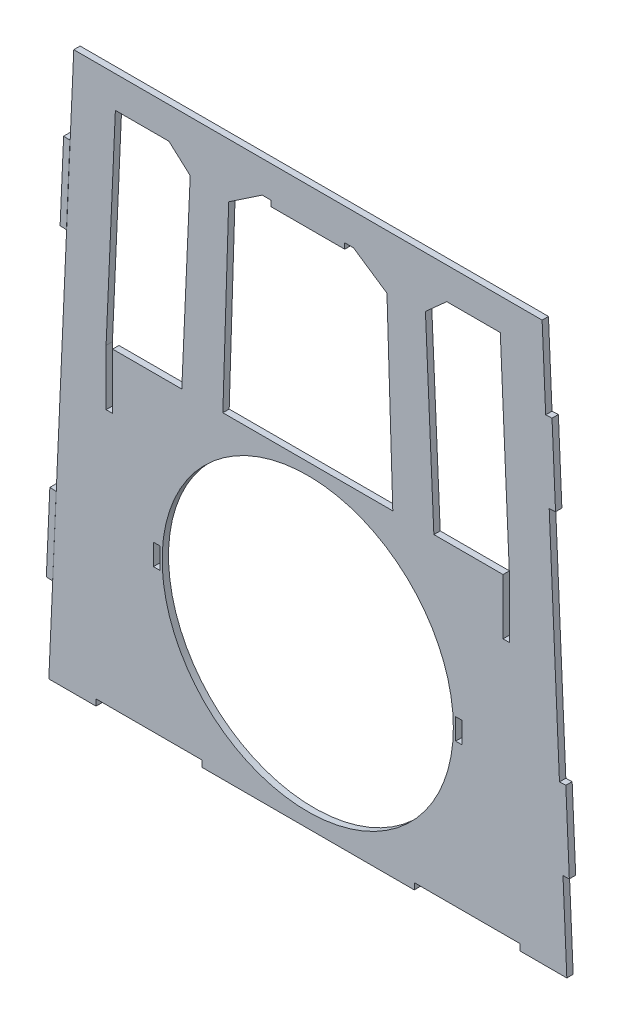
ISO-10303-21;
HEADER;
FILE_DESCRIPTION(('STEP AP214'),'2;1');
FILE_NAME('part.step','',(''),(''),'','','');
FILE_SCHEMA(('AUTOMOTIVE_DESIGN { 1 0 10303 214 1 1 1 1 }'));
ENDSEC;
DATA;
#1=APPLICATION_CONTEXT('core data for automotive mechanical design processes');
#2=APPLICATION_PROTOCOL_DEFINITION('international standard','automotive_design',2000,#1);
#3=PRODUCT_CONTEXT('',#1,'mechanical');
#4=PRODUCT('Part','Part','',(#3));
#5=PRODUCT_RELATED_PRODUCT_CATEGORY('part','',(#4));
#6=PRODUCT_DEFINITION_FORMATION('','',#4);
#7=PRODUCT_DEFINITION_CONTEXT('part definition',#1,'design');
#8=PRODUCT_DEFINITION('design','',#6,#7);
#9=PRODUCT_DEFINITION_SHAPE('','',#8);
#10=(LENGTH_UNIT() NAMED_UNIT(*) SI_UNIT(.MILLI.,.METRE.));
#11=(NAMED_UNIT(*) PLANE_ANGLE_UNIT() SI_UNIT($,.RADIAN.));
#12=(NAMED_UNIT(*) SI_UNIT($,.STERADIAN.) SOLID_ANGLE_UNIT());
#13=UNCERTAINTY_MEASURE_WITH_UNIT(LENGTH_MEASURE(1.E-05),#10,'distance_accuracy_value','');
#14=(GEOMETRIC_REPRESENTATION_CONTEXT(3) GLOBAL_UNCERTAINTY_ASSIGNED_CONTEXT((#13)) GLOBAL_UNIT_ASSIGNED_CONTEXT((#10,
#11,#12)) REPRESENTATION_CONTEXT('',''));
#15=CARTESIAN_POINT('',(0.,0.,0.));
#16=DIRECTION('',(0.,0.,1.));
#17=DIRECTION('',(1.,0.,0.));
#18=AXIS2_PLACEMENT_3D('',#15,#16,#17);
#19=CARTESIAN_POINT('',(-57.8739815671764,82.1443334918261,0.));
#20=DIRECTION('',(-0.0443029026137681,-0.999018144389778,0.));
#21=DIRECTION('',(0.999018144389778,-0.0443029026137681,0.));
#22=AXIS2_PLACEMENT_3D('',#19,#20,#21);
#23=PLANE('',#22);
#24=DIRECTION('',(0.999018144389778,-0.0443029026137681,0.));
#25=VECTOR('',#24,1.);
#26=CARTESIAN_POINT('',(-57.8739815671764,82.1443334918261,1.524));
#27=LINE('',#26,#25);
#28=CARTESIAN_POINT('',(-59.3964852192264,82.2118511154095,1.524));
#29=VERTEX_POINT('',#28);
#30=CARTESIAN_POINT('',(-57.8739815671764,82.1443334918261,1.524));
#31=VERTEX_POINT('',#30);
#32=EDGE_CURVE('E113',#29,#31,#27,.T.);
#33=ORIENTED_EDGE('',*,*,#32,.F.);
#34=DIRECTION('',(0.,0.,1.));
#35=VECTOR('',#34,1.);
#36=CARTESIAN_POINT('',(-59.3964852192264,82.2118511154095,0.));
#37=LINE('',#36,#35);
#38=CARTESIAN_POINT('',(-59.3964852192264,82.2118511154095,0.));
#39=VERTEX_POINT('',#38);
#40=EDGE_CURVE('E12',#39,#29,#37,.T.);
#41=ORIENTED_EDGE('',*,*,#40,.F.);
#42=DIRECTION('',(0.999018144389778,-0.0443029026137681,0.));
#43=VECTOR('',#42,1.);
#44=CARTESIAN_POINT('',(-57.8739815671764,82.1443334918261,0.));
#45=LINE('',#44,#43);
#46=CARTESIAN_POINT('',(-57.8739815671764,82.1443334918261,0.));
#47=VERTEX_POINT('',#46);
#48=EDGE_CURVE('E107',#39,#47,#45,.T.);
#49=ORIENTED_EDGE('',*,*,#48,.T.);
#50=DIRECTION('',(0.,0.,1.));
#51=VECTOR('',#50,1.);
#52=CARTESIAN_POINT('',(-57.8739815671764,82.1443334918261,0.));
#53=LINE('',#52,#51);
#54=EDGE_CURVE('E52',#47,#31,#53,.T.);
#55=ORIENTED_EDGE('',*,*,#54,.T.);
#56=EDGE_LOOP('',(#33,#41,#49,#55));
#57=FACE_BOUND('',#56,.T.);
#58=ADVANCED_FACE('F49',(#57),#23,.T.);
#59=CARTESIAN_POINT('',(-59.3964852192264,82.2118511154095,0.));
#60=DIRECTION('',(-0.999018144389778,0.0443029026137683,0.));
#61=DIRECTION('',(-0.0443029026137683,-0.999018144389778,0.));
#62=AXIS2_PLACEMENT_3D('',#59,#60,#61);
#63=PLANE('',#62);
#64=DIRECTION('',(-0.0443029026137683,-0.999018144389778,0.));
#65=VECTOR('',#64,1.);
#66=CARTESIAN_POINT('',(-59.3964852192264,82.2118511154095,1.524));
#67=LINE('',#66,#65);
#68=CARTESIAN_POINT('',(-58.5525149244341,101.243146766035,1.524));
#69=VERTEX_POINT('',#68);
#70=EDGE_CURVE('E109',#69,#29,#67,.T.);
#71=ORIENTED_EDGE('',*,*,#70,.F.);
#72=DIRECTION('',(0.,0.,1.));
#73=VECTOR('',#72,1.);
#74=CARTESIAN_POINT('',(-58.5525149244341,101.243146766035,0.));
#75=LINE('',#74,#73);
#76=CARTESIAN_POINT('',(-58.5525149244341,101.243146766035,0.));
#77=VERTEX_POINT('',#76);
#78=EDGE_CURVE('E58',#77,#69,#75,.T.);
#79=ORIENTED_EDGE('',*,*,#78,.F.);
#80=DIRECTION('',(-0.0443029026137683,-0.999018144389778,0.));
#81=VECTOR('',#80,1.);
#82=CARTESIAN_POINT('',(-59.3964852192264,82.2118511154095,0.));
#83=LINE('',#82,#81);
#84=EDGE_CURVE('E104',#77,#39,#83,.T.);
#85=ORIENTED_EDGE('',*,*,#84,.T.);
#86=ORIENTED_EDGE('',*,*,#40,.T.);
#87=EDGE_LOOP('',(#71,#79,#85,#86));
#88=FACE_BOUND('',#87,.T.);
#89=ADVANCED_FACE('F123',(#88),#63,.T.);
#90=CARTESIAN_POINT('',(-57.0300112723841,101.175629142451,0.));
#91=DIRECTION('',(0.0443029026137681,0.999018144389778,0.));
#92=DIRECTION('',(-0.999018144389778,0.0443029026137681,0.));
#93=AXIS2_PLACEMENT_3D('',#90,#91,#92);
#94=PLANE('',#93);
#95=DIRECTION('',(-0.999018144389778,0.0443029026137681,0.));
#96=VECTOR('',#95,1.);
#97=CARTESIAN_POINT('',(-57.0300112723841,101.175629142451,1.524));
#98=LINE('',#97,#96);
#99=CARTESIAN_POINT('',(-57.0300112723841,101.175629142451,1.524));
#100=VERTEX_POINT('',#99);
#101=EDGE_CURVE('E99',#100,#69,#98,.T.);
#102=ORIENTED_EDGE('',*,*,#101,.F.);
#103=DIRECTION('',(0.,0.,1.));
#104=VECTOR('',#103,1.);
#105=CARTESIAN_POINT('',(-57.0300112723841,101.175629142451,0.));
#106=LINE('',#105,#104);
#107=CARTESIAN_POINT('',(-57.0300112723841,101.175629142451,0.));
#108=VERTEX_POINT('',#107);
#109=EDGE_CURVE('E94',#108,#100,#106,.T.);
#110=ORIENTED_EDGE('',*,*,#109,.F.);
#111=DIRECTION('',(-0.999018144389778,0.0443029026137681,0.));
#112=VECTOR('',#111,1.);
#113=CARTESIAN_POINT('',(-57.0300112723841,101.175629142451,0.));
#114=LINE('',#113,#112);
#115=EDGE_CURVE('E97',#108,#77,#114,.T.);
#116=ORIENTED_EDGE('',*,*,#115,.T.);
#117=ORIENTED_EDGE('',*,*,#78,.T.);
#118=EDGE_LOOP('',(#102,#110,#116,#117));
#119=FACE_BOUND('',#118,.T.);
#120=ADVANCED_FACE('F96',(#119),#94,.T.);
#121=CARTESIAN_POINT('',(-57.8739815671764,82.1443334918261,0.));
#122=DIRECTION('',(0.999018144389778,-0.0443029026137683,0.));
#123=DIRECTION('',(0.0443029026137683,0.999018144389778,0.));
#124=AXIS2_PLACEMENT_3D('',#121,#122,#123);
#125=PLANE('',#124);
#126=DIRECTION('',(0.0443029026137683,0.999018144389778,0.));
#127=VECTOR('',#126,1.);
#128=CARTESIAN_POINT('',(-57.8739815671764,82.1443334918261,1.524));
#129=LINE('',#128,#127);
#130=EDGE_CURVE('E116',#31,#100,#129,.T.);
#131=ORIENTED_EDGE('',*,*,#130,.F.);
#132=ORIENTED_EDGE('',*,*,#54,.F.);
#133=DIRECTION('',(0.0443029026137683,0.999018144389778,0.));
#134=VECTOR('',#133,1.);
#135=CARTESIAN_POINT('',(-57.8739815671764,82.1443334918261,0.));
#136=LINE('',#135,#134);
#137=EDGE_CURVE('E103',#47,#108,#136,.T.);
#138=ORIENTED_EDGE('',*,*,#137,.T.);
#139=ORIENTED_EDGE('',*,*,#109,.T.);
#140=EDGE_LOOP('',(#131,#132,#138,#139));
#141=FACE_BOUND('',#140,.T.);
#142=ADVANCED_FACE('F106',(#141),#125,.T.);
#143=CARTESIAN_POINT('',(0.,0.,0.));
#144=DIRECTION('',(0.,0.,-1.));
#145=DIRECTION('',(-1.,0.,0.));
#146=AXIS2_PLACEMENT_3D('',#143,#144,#145);
#147=PLANE('',#146);
#148=ORIENTED_EDGE('',*,*,#48,.F.);
#149=ORIENTED_EDGE('',*,*,#84,.F.);
#150=ORIENTED_EDGE('',*,*,#115,.F.);
#151=ORIENTED_EDGE('',*,*,#137,.F.);
#152=EDGE_LOOP('',(#148,#149,#150,#151));
#153=FACE_BOUND('',#152,.T.);
#154=ADVANCED_FACE('F102',(#153),#147,.T.);
#155=CARTESIAN_POINT('',(0.,0.,1.524));
#156=DIRECTION('',(0.,0.,-1.));
#157=DIRECTION('',(-1.,0.,0.));
#158=AXIS2_PLACEMENT_3D('',#155,#156,#157);
#159=PLANE('',#158);
#160=ORIENTED_EDGE('',*,*,#32,.T.);
#161=ORIENTED_EDGE('',*,*,#130,.T.);
#162=ORIENTED_EDGE('',*,*,#101,.T.);
#163=ORIENTED_EDGE('',*,*,#70,.T.);
#164=EDGE_LOOP('',(#160,#161,#162,#163));
#165=FACE_BOUND('',#164,.T.);
#166=ADVANCED_FACE('F122',(#165),#159,.F.);
#167=CLOSED_SHELL('',(#58,#89,#120,#142,#154,#166));
#168=MANIFOLD_SOLID_BREP('B2',#167);
#169=CARTESIAN_POINT('',(-61.1821890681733,7.54517352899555,0.));
#170=DIRECTION('',(-0.0443029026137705,-0.999018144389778,0.));
#171=DIRECTION('',(0.999018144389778,-0.0443029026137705,0.));
#172=AXIS2_PLACEMENT_3D('',#169,#170,#171);
#173=PLANE('',#172);
#174=DIRECTION('',(0.999018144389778,-0.0443029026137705,0.));
#175=VECTOR('',#174,1.);
#176=CARTESIAN_POINT('',(-61.1821890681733,7.54517352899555,1.524));
#177=LINE('',#176,#175);
#178=CARTESIAN_POINT('',(-62.7046927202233,7.61269115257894,1.524));
#179=VERTEX_POINT('',#178);
#180=CARTESIAN_POINT('',(-61.1821890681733,7.54517352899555,1.524));
#181=VERTEX_POINT('',#180);
#182=EDGE_CURVE('E245',#179,#181,#177,.T.);
#183=ORIENTED_EDGE('',*,*,#182,.F.);
#184=DIRECTION('',(0.,0.,1.));
#185=VECTOR('',#184,1.);
#186=CARTESIAN_POINT('',(-62.7046927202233,7.61269115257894,0.));
#187=LINE('',#186,#185);
#188=CARTESIAN_POINT('',(-62.7046927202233,7.61269115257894,0.));
#189=VERTEX_POINT('',#188);
#190=EDGE_CURVE('E47',#189,#179,#187,.T.);
#191=ORIENTED_EDGE('',*,*,#190,.F.);
#192=DIRECTION('',(0.999018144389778,-0.0443029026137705,0.));
#193=VECTOR('',#192,1.);
#194=CARTESIAN_POINT('',(-61.1821890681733,7.54517352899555,0.));
#195=LINE('',#194,#193);
#196=CARTESIAN_POINT('',(-61.1821890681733,7.54517352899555,0.));
#197=VERTEX_POINT('',#196);
#198=EDGE_CURVE('E239',#189,#197,#195,.T.);
#199=ORIENTED_EDGE('',*,*,#198,.T.);
#200=DIRECTION('',(0.,0.,1.));
#201=VECTOR('',#200,1.);
#202=CARTESIAN_POINT('',(-61.1821890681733,7.54517352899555,0.));
#203=LINE('',#202,#201);
#204=EDGE_CURVE('E184',#197,#181,#203,.T.);
#205=ORIENTED_EDGE('',*,*,#204,.T.);
#206=EDGE_LOOP('',(#183,#191,#199,#205));
#207=FACE_BOUND('',#206,.T.);
#208=ADVANCED_FACE('F181',(#207),#173,.T.);
#209=CARTESIAN_POINT('',(-62.7046927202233,7.61269115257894,0.));
#210=DIRECTION('',(-0.999018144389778,0.0443029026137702,0.));
#211=DIRECTION('',(-0.0443029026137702,-0.999018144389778,0.));
#212=AXIS2_PLACEMENT_3D('',#209,#210,#211);
#213=PLANE('',#212);
#214=DIRECTION('',(-0.0443029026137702,-0.999018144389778,0.));
#215=VECTOR('',#214,1.);
#216=CARTESIAN_POINT('',(-62.7046927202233,7.61269115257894,1.524));
#217=LINE('',#216,#215);
#218=CARTESIAN_POINT('',(-61.860722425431,26.6439868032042,1.524));
#219=VERTEX_POINT('',#218);
#220=EDGE_CURVE('E241',#219,#179,#217,.T.);
#221=ORIENTED_EDGE('',*,*,#220,.F.);
#222=DIRECTION('',(0.,0.,1.));
#223=VECTOR('',#222,1.);
#224=CARTESIAN_POINT('',(-61.860722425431,26.6439868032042,0.));
#225=LINE('',#224,#223);
#226=CARTESIAN_POINT('',(-61.860722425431,26.6439868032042,0.));
#227=VERTEX_POINT('',#226);
#228=EDGE_CURVE('E190',#227,#219,#225,.T.);
#229=ORIENTED_EDGE('',*,*,#228,.F.);
#230=DIRECTION('',(-0.0443029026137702,-0.999018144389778,0.));
#231=VECTOR('',#230,1.);
#232=CARTESIAN_POINT('',(-62.7046927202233,7.61269115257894,0.));
#233=LINE('',#232,#231);
#234=EDGE_CURVE('E236',#227,#189,#233,.T.);
#235=ORIENTED_EDGE('',*,*,#234,.T.);
#236=ORIENTED_EDGE('',*,*,#190,.T.);
#237=EDGE_LOOP('',(#221,#229,#235,#236));
#238=FACE_BOUND('',#237,.T.);
#239=ADVANCED_FACE('F255',(#238),#213,.T.);
#240=CARTESIAN_POINT('',(-60.338218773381,26.5764691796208,0.));
#241=DIRECTION('',(0.0443029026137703,0.999018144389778,0.));
#242=DIRECTION('',(-0.999018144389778,0.0443029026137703,0.));
#243=AXIS2_PLACEMENT_3D('',#240,#241,#242);
#244=PLANE('',#243);
#245=DIRECTION('',(-0.999018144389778,0.0443029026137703,0.));
#246=VECTOR('',#245,1.);
#247=CARTESIAN_POINT('',(-60.338218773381,26.5764691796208,1.524));
#248=LINE('',#247,#246);
#249=CARTESIAN_POINT('',(-60.338218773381,26.5764691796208,1.524));
#250=VERTEX_POINT('',#249);
#251=EDGE_CURVE('E231',#250,#219,#248,.T.);
#252=ORIENTED_EDGE('',*,*,#251,.F.);
#253=DIRECTION('',(0.,0.,1.));
#254=VECTOR('',#253,1.);
#255=CARTESIAN_POINT('',(-60.338218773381,26.5764691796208,0.));
#256=LINE('',#255,#254);
#257=CARTESIAN_POINT('',(-60.338218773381,26.5764691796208,0.));
#258=VERTEX_POINT('',#257);
#259=EDGE_CURVE('E226',#258,#250,#256,.T.);
#260=ORIENTED_EDGE('',*,*,#259,.F.);
#261=DIRECTION('',(-0.999018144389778,0.0443029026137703,0.));
#262=VECTOR('',#261,1.);
#263=CARTESIAN_POINT('',(-60.338218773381,26.5764691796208,0.));
#264=LINE('',#263,#262);
#265=EDGE_CURVE('E229',#258,#227,#264,.T.);
#266=ORIENTED_EDGE('',*,*,#265,.T.);
#267=ORIENTED_EDGE('',*,*,#228,.T.);
#268=EDGE_LOOP('',(#252,#260,#266,#267));
#269=FACE_BOUND('',#268,.T.);
#270=ADVANCED_FACE('F228',(#269),#244,.T.);
#271=CARTESIAN_POINT('',(-61.1821890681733,7.54517352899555,0.));
#272=DIRECTION('',(0.999018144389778,-0.0443029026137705,0.));
#273=DIRECTION('',(0.0443029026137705,0.999018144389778,0.));
#274=AXIS2_PLACEMENT_3D('',#271,#272,#273);
#275=PLANE('',#274);
#276=DIRECTION('',(0.0443029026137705,0.999018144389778,0.));
#277=VECTOR('',#276,1.);
#278=CARTESIAN_POINT('',(-61.1821890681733,7.54517352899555,1.524));
#279=LINE('',#278,#277);
#280=EDGE_CURVE('E248',#181,#250,#279,.T.);
#281=ORIENTED_EDGE('',*,*,#280,.F.);
#282=ORIENTED_EDGE('',*,*,#204,.F.);
#283=DIRECTION('',(0.0443029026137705,0.999018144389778,0.));
#284=VECTOR('',#283,1.);
#285=CARTESIAN_POINT('',(-61.1821890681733,7.54517352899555,0.));
#286=LINE('',#285,#284);
#287=EDGE_CURVE('E235',#197,#258,#286,.T.);
#288=ORIENTED_EDGE('',*,*,#287,.T.);
#289=ORIENTED_EDGE('',*,*,#259,.T.);
#290=EDGE_LOOP('',(#281,#282,#288,#289));
#291=FACE_BOUND('',#290,.T.);
#292=ADVANCED_FACE('F238',(#291),#275,.T.);
#293=CARTESIAN_POINT('',(0.,0.,0.));
#294=DIRECTION('',(0.,0.,-1.));
#295=DIRECTION('',(-1.,0.,0.));
#296=AXIS2_PLACEMENT_3D('',#293,#294,#295);
#297=PLANE('',#296);
#298=ORIENTED_EDGE('',*,*,#198,.F.);
#299=ORIENTED_EDGE('',*,*,#234,.F.);
#300=ORIENTED_EDGE('',*,*,#265,.F.);
#301=ORIENTED_EDGE('',*,*,#287,.F.);
#302=EDGE_LOOP('',(#298,#299,#300,#301));
#303=FACE_BOUND('',#302,.T.);
#304=ADVANCED_FACE('F234',(#303),#297,.T.);
#305=CARTESIAN_POINT('',(0.,0.,1.524));
#306=DIRECTION('',(0.,0.,-1.));
#307=DIRECTION('',(-1.,0.,0.));
#308=AXIS2_PLACEMENT_3D('',#305,#306,#307);
#309=PLANE('',#308);
#310=ORIENTED_EDGE('',*,*,#182,.T.);
#311=ORIENTED_EDGE('',*,*,#280,.T.);
#312=ORIENTED_EDGE('',*,*,#251,.T.);
#313=ORIENTED_EDGE('',*,*,#220,.T.);
#314=EDGE_LOOP('',(#310,#311,#312,#313));
#315=FACE_BOUND('',#314,.T.);
#316=ADVANCED_FACE('F254',(#315),#309,.F.);
#317=CLOSED_SHELL('',(#208,#239,#270,#292,#304,#316));
#318=MANIFOLD_SOLID_BREP('B6',#317);
#319=CARTESIAN_POINT('',(0.,-13.2697803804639,1.524));
#320=DIRECTION('',(0.,-1.,0.));
#321=DIRECTION('',(0.,0.,-1.));
#322=AXIS2_PLACEMENT_3D('',#319,#320,#321);
#323=PLANE('',#322);
#324=DIRECTION('',(0.,0.,1.));
#325=VECTOR('',#324,1.);
#326=CARTESIAN_POINT('',(-50.791018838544,-13.2697803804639,0.));
#327=LINE('',#326,#325);
#328=CARTESIAN_POINT('',(-50.791018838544,-13.2697803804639,0.));
#329=VERTEX_POINT('',#328);
#330=CARTESIAN_POINT('',(-50.791018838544,-13.2697803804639,1.524));
#331=VERTEX_POINT('',#330);
#332=EDGE_CURVE('E955',#329,#331,#327,.T.);
#333=ORIENTED_EDGE('',*,*,#332,.T.);
#334=DIRECTION('',(-1.,0.,0.));
#335=VECTOR('',#334,1.);
#336=CARTESIAN_POINT('',(0.,-13.2697803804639,1.524));
#337=LINE('',#336,#335);
#338=CARTESIAN_POINT('',(-62.1052582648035,-13.269780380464,1.524));
#339=VERTEX_POINT('',#338);
#340=EDGE_CURVE('E1102',#331,#339,#337,.T.);
#341=ORIENTED_EDGE('',*,*,#340,.T.);
#342=DIRECTION('',(0.,0.,-1.));
#343=VECTOR('',#342,1.);
#344=CARTESIAN_POINT('',(-62.1052582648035,-13.269780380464,1.524));
#345=LINE('',#344,#343);
#346=CARTESIAN_POINT('',(-62.1052582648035,-13.269780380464,0.));
#347=VERTEX_POINT('',#346);
#348=EDGE_CURVE('E702',#339,#347,#345,.T.);
#349=ORIENTED_EDGE('',*,*,#348,.T.);
#350=DIRECTION('',(-1.,0.,0.));
#351=VECTOR('',#350,1.);
#352=CARTESIAN_POINT('',(0.,-13.2697803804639,0.));
#353=LINE('',#352,#351);
#354=EDGE_CURVE('E681',#329,#347,#353,.T.);
#355=ORIENTED_EDGE('',*,*,#354,.F.);
#356=EDGE_LOOP('',(#333,#341,#349,#355));
#357=FACE_BOUND('',#356,.T.);
#358=ADVANCED_FACE('F304',(#357),#323,.T.);
#359=DIRECTION('',(0.,0.,1.));
#360=VECTOR('',#359,1.);
#361=CARTESIAN_POINT('',(-25.391018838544,-13.2697803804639,0.));
#362=LINE('',#361,#360);
#363=CARTESIAN_POINT('',(-25.391018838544,-13.2697803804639,0.));
#364=VERTEX_POINT('',#363);
#365=CARTESIAN_POINT('',(-25.391018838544,-13.2697803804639,1.524));
#366=VERTEX_POINT('',#365);
#367=EDGE_CURVE('E958',#364,#366,#362,.T.);
#368=ORIENTED_EDGE('',*,*,#367,.F.);
#369=CARTESIAN_POINT('',(25.5472930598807,-13.2697803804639,0.));
#370=VERTEX_POINT('',#369);
#371=EDGE_CURVE('E686',#370,#364,#353,.T.);
#372=ORIENTED_EDGE('',*,*,#371,.F.);
#373=DIRECTION('',(0.,0.,1.));
#374=VECTOR('',#373,1.);
#375=CARTESIAN_POINT('',(25.5472930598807,-13.2697803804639,0.));
#376=LINE('',#375,#374);
#377=CARTESIAN_POINT('',(25.5472930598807,-13.2697803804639,1.524));
#378=VERTEX_POINT('',#377);
#379=EDGE_CURVE('E931',#370,#378,#376,.T.);
#380=ORIENTED_EDGE('',*,*,#379,.T.);
#381=EDGE_CURVE('E1175',#378,#366,#337,.T.);
#382=ORIENTED_EDGE('',*,*,#381,.T.);
#383=EDGE_LOOP('',(#368,#372,#380,#382));
#384=FACE_BOUND('',#383,.T.);
#385=ADVANCED_FACE('F1145',(#384),#323,.T.);
#386=CARTESIAN_POINT('',(61.4328007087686,2.72432628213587,1.524));
#387=DIRECTION('',(0.999018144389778,0.0443029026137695,0.));
#388=DIRECTION('',(-0.0443029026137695,0.999018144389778,0.));
#389=AXIS2_PLACEMENT_3D('',#386,#387,#388);
#390=PLANE('',#389);
#391=DIRECTION('',(0.,0.,1.));
#392=VECTOR('',#391,1.);
#393=CARTESIAN_POINT('',(60.3750429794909,26.5764691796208,0.));
#394=LINE('',#393,#392);
#395=CARTESIAN_POINT('',(60.3750429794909,26.5764691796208,0.));
#396=VERTEX_POINT('',#395);
#397=CARTESIAN_POINT('',(60.3750429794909,26.5764691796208,1.524));
#398=VERTEX_POINT('',#397);
#399=EDGE_CURVE('E880',#396,#398,#394,.T.);
#400=ORIENTED_EDGE('',*,*,#399,.F.);
#401=DIRECTION('',(0.0443029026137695,-0.999018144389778,0.));
#402=VECTOR('',#401,1.);
#403=CARTESIAN_POINT('',(61.4328007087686,2.72432628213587,0.));
#404=LINE('',#403,#402);
#405=CARTESIAN_POINT('',(57.9108057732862,82.1443334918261,0.));
#406=VERTEX_POINT('',#405);
#407=EDGE_CURVE('E694',#406,#396,#404,.T.);
#408=ORIENTED_EDGE('',*,*,#407,.F.);
#409=DIRECTION('',(0.,0.,1.));
#410=VECTOR('',#409,1.);
#411=CARTESIAN_POINT('',(57.9108057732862,82.1443334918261,0.));
#412=LINE('',#411,#410);
#413=CARTESIAN_POINT('',(57.9108057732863,82.1443334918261,1.524));
#414=VERTEX_POINT('',#413);
#415=EDGE_CURVE('E838',#406,#414,#412,.T.);
#416=ORIENTED_EDGE('',*,*,#415,.T.);
#417=DIRECTION('',(0.0443029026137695,-0.999018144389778,0.));
#418=VECTOR('',#417,1.);
#419=CARTESIAN_POINT('',(61.4328007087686,2.72432628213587,1.524));
#420=LINE('',#419,#418);
#421=EDGE_CURVE('E863',#414,#398,#420,.T.);
#422=ORIENTED_EDGE('',*,*,#421,.T.);
#423=EDGE_LOOP('',(#400,#408,#416,#422));
#424=FACE_BOUND('',#423,.T.);
#425=ADVANCED_FACE('F878',(#424),#390,.T.);
#426=DIRECTION('',(0.,0.,1.));
#427=VECTOR('',#426,1.);
#428=CARTESIAN_POINT('',(61.2190132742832,7.54517352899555,0.));
#429=LINE('',#428,#427);
#430=CARTESIAN_POINT('',(61.2190132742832,7.54517352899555,0.));
#431=VERTEX_POINT('',#430);
#432=CARTESIAN_POINT('',(61.2190132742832,7.54517352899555,1.524));
#433=VERTEX_POINT('',#432);
#434=EDGE_CURVE('E908',#431,#433,#429,.T.);
#435=ORIENTED_EDGE('',*,*,#434,.T.);
#436=CARTESIAN_POINT('',(62.1420824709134,-13.2697803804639,1.524));
#437=VERTEX_POINT('',#436);
#438=EDGE_CURVE('E861',#433,#437,#420,.T.);
#439=ORIENTED_EDGE('',*,*,#438,.T.);
#440=DIRECTION('',(0.,0.,-1.));
#441=VECTOR('',#440,1.);
#442=CARTESIAN_POINT('',(62.1420824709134,-13.2697803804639,1.524));
#443=LINE('',#442,#441);
#444=CARTESIAN_POINT('',(62.1420824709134,-13.2697803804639,0.));
#445=VERTEX_POINT('',#444);
#446=EDGE_CURVE('E712',#437,#445,#443,.T.);
#447=ORIENTED_EDGE('',*,*,#446,.T.);
#448=EDGE_CURVE('E685',#431,#445,#404,.T.);
#449=ORIENTED_EDGE('',*,*,#448,.F.);
#450=EDGE_LOOP('',(#435,#439,#447,#449));
#451=FACE_BOUND('',#450,.T.);
#452=ADVANCED_FACE('F1162',(#451),#390,.T.);
#453=CARTESIAN_POINT('',(0.,62.8910861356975,1.524));
#454=DIRECTION('',(0.,1.,0.));
#455=DIRECTION('',(0.,0.,1.));
#456=AXIS2_PLACEMENT_3D('',#453,#454,#455);
#457=PLANE('',#456);
#458=DIRECTION('',(1.,0.,0.));
#459=VECTOR('',#458,1.);
#460=CARTESIAN_POINT('',(0.,62.8910861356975,0.));
#461=LINE('',#460,#459);
#462=CARTESIAN_POINT('',(-20.3646078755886,62.8910861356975,0.));
#463=VERTEX_POINT('',#462);
#464=CARTESIAN_POINT('',(20.4014320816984,62.8910861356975,0.));
#465=VERTEX_POINT('',#464);
#466=EDGE_CURVE('E779',#463,#465,#461,.T.);
#467=ORIENTED_EDGE('',*,*,#466,.F.);
#468=DIRECTION('',(0.,0.,-1.));
#469=VECTOR('',#468,1.);
#470=CARTESIAN_POINT('',(-20.3646078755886,62.8910861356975,1.524));
#471=LINE('',#470,#469);
#472=CARTESIAN_POINT('',(-20.3646078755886,62.8910861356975,1.524));
#473=VERTEX_POINT('',#472);
#474=EDGE_CURVE('E179',#473,#463,#471,.T.);
#475=ORIENTED_EDGE('',*,*,#474,.F.);
#476=DIRECTION('',(1.,0.,0.));
#477=VECTOR('',#476,1.);
#478=CARTESIAN_POINT('',(0.,62.8910861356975,1.524));
#479=LINE('',#478,#477);
#480=CARTESIAN_POINT('',(20.4014320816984,62.8910861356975,1.524));
#481=VERTEX_POINT('',#480);
#482=EDGE_CURVE('E1200',#473,#481,#479,.T.);
#483=ORIENTED_EDGE('',*,*,#482,.T.);
#484=DIRECTION('',(0.,0.,-1.));
#485=VECTOR('',#484,1.);
#486=CARTESIAN_POINT('',(20.4014320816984,62.8910861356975,1.524));
#487=LINE('',#486,#485);
#488=EDGE_CURVE('E724',#481,#465,#487,.T.);
#489=ORIENTED_EDGE('',*,*,#488,.T.);
#490=EDGE_LOOP('',(#467,#475,#483,#489));
#491=FACE_BOUND('',#490,.T.);
#492=ADVANCED_FACE('F1243',(#491),#457,.T.);
#493=CARTESIAN_POINT('',(-22.3225720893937,0.702814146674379,1.524));
#494=DIRECTION('',(-0.999504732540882,0.0314688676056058,0.));
#495=DIRECTION('',(-0.0314688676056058,-0.999504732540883,0.));
#496=AXIS2_PLACEMENT_3D('',#493,#494,#495);
#497=PLANE('',#496);
#498=DIRECTION('',(0.0314688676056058,0.999504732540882,0.));
#499=VECTOR('',#498,1.);
#500=CARTESIAN_POINT('',(-22.3225720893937,0.702814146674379,0.));
#501=LINE('',#500,#499);
#502=CARTESIAN_POINT('',(-18.9630269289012,107.407679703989,0.));
#503=VERTEX_POINT('',#502);
#504=EDGE_CURVE('E776',#463,#503,#501,.T.);
#505=ORIENTED_EDGE('',*,*,#504,.T.);
#506=DIRECTION('',(0.,0.,-1.));
#507=VECTOR('',#506,1.);
#508=CARTESIAN_POINT('',(-18.9630269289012,107.407679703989,1.524));
#509=LINE('',#508,#507);
#510=CARTESIAN_POINT('',(-18.9630269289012,107.407679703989,1.524));
#511=VERTEX_POINT('',#510);
#512=EDGE_CURVE('E313',#511,#503,#509,.T.);
#513=ORIENTED_EDGE('',*,*,#512,.F.);
#514=DIRECTION('',(0.0314688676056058,0.999504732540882,0.));
#515=VECTOR('',#514,1.);
#516=CARTESIAN_POINT('',(-22.3225720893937,0.702814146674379,1.524));
#517=LINE('',#516,#515);
#518=EDGE_CURVE('E1203',#473,#511,#517,.T.);
#519=ORIENTED_EDGE('',*,*,#518,.F.);
#520=ORIENTED_EDGE('',*,*,#474,.T.);
#521=EDGE_LOOP('',(#505,#513,#519,#520));
#522=FACE_BOUND('',#521,.T.);
#523=ADVANCED_FACE('F1247',(#522),#497,.F.);
#524=CARTESIAN_POINT('',(-55.7028214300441,82.6450250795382,1.524));
#525=DIRECTION('',(-0.558903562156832,0.829232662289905,0.));
#526=DIRECTION('',(-0.829232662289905,-0.558903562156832,0.));
#527=AXIS2_PLACEMENT_3D('',#524,#525,#526);
#528=PLANE('',#527);
#529=DIRECTION('',(0.829232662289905,0.558903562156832,0.));
#530=VECTOR('',#529,1.);
#531=CARTESIAN_POINT('',(-55.7028214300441,82.6450250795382,0.));
#532=LINE('',#531,#530);
#533=CARTESIAN_POINT('',(-10.9357905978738,112.818044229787,0.));
#534=VERTEX_POINT('',#533);
#535=EDGE_CURVE('E773',#503,#534,#532,.T.);
#536=ORIENTED_EDGE('',*,*,#535,.T.);
#537=DIRECTION('',(0.,0.,-1.));
#538=VECTOR('',#537,1.);
#539=CARTESIAN_POINT('',(-10.9357905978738,112.818044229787,1.524));
#540=LINE('',#539,#538);
#541=CARTESIAN_POINT('',(-10.9357905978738,112.818044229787,1.524));
#542=VERTEX_POINT('',#541);
#543=EDGE_CURVE('E734',#542,#534,#540,.T.);
#544=ORIENTED_EDGE('',*,*,#543,.F.);
#545=DIRECTION('',(0.829232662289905,0.558903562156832,0.));
#546=VECTOR('',#545,1.);
#547=CARTESIAN_POINT('',(-55.7028214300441,82.6450250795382,1.524));
#548=LINE('',#547,#546);
#549=EDGE_CURVE('E1206',#511,#542,#548,.T.);
#550=ORIENTED_EDGE('',*,*,#549,.F.);
#551=ORIENTED_EDGE('',*,*,#512,.T.);
#552=EDGE_LOOP('',(#536,#544,#550,#551));
#553=FACE_BOUND('',#552,.T.);
#554=ADVANCED_FACE('F1251',(#553),#528,.F.);
#555=CARTESIAN_POINT('',(0.,112.818044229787,1.524));
#556=DIRECTION('',(0.,1.,0.));
#557=DIRECTION('',(0.,0.,1.));
#558=AXIS2_PLACEMENT_3D('',#555,#556,#557);
#559=PLANE('',#558);
#560=DIRECTION('',(1.,0.,0.));
#561=VECTOR('',#560,1.);
#562=CARTESIAN_POINT('',(0.,112.818044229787,0.));
#563=LINE('',#562,#561);
#564=CARTESIAN_POINT('',(-8.82832975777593,112.818044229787,0.));
#565=VERTEX_POINT('',#564);
#566=EDGE_CURVE('E770',#534,#565,#563,.T.);
#567=ORIENTED_EDGE('',*,*,#566,.T.);
#568=DIRECTION('',(0.,0.,-1.));
#569=VECTOR('',#568,1.);
#570=CARTESIAN_POINT('',(-8.82832975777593,112.818044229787,1.524));
#571=LINE('',#570,#569);
#572=CARTESIAN_POINT('',(-8.82832975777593,112.818044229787,1.524));
#573=VERTEX_POINT('',#572);
#574=EDGE_CURVE('E737',#573,#565,#571,.T.);
#575=ORIENTED_EDGE('',*,*,#574,.F.);
#576=DIRECTION('',(1.,0.,0.));
#577=VECTOR('',#576,1.);
#578=CARTESIAN_POINT('',(0.,112.818044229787,1.524));
#579=LINE('',#578,#577);
#580=EDGE_CURVE('E1209',#542,#573,#579,.T.);
#581=ORIENTED_EDGE('',*,*,#580,.F.);
#582=ORIENTED_EDGE('',*,*,#543,.T.);
#583=EDGE_LOOP('',(#567,#575,#581,#582));
#584=FACE_BOUND('',#583,.T.);
#585=ADVANCED_FACE('F1253',(#584),#559,.F.);
#586=CARTESIAN_POINT('',(-8.82832975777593,0.,1.524));
#587=DIRECTION('',(1.,0.,0.));
#588=DIRECTION('',(0.,0.,-1.));
#589=AXIS2_PLACEMENT_3D('',#586,#587,#588);
#590=PLANE('',#589);
#591=DIRECTION('',(0.,-1.,0.));
#592=VECTOR('',#591,1.);
#593=CARTESIAN_POINT('',(-8.82832975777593,0.,0.));
#594=LINE('',#593,#592);
#595=CARTESIAN_POINT('',(-8.82832975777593,111.468807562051,0.));
#596=VERTEX_POINT('',#595);
#597=EDGE_CURVE('E767',#565,#596,#594,.T.);
#598=ORIENTED_EDGE('',*,*,#597,.T.);
#599=DIRECTION('',(0.,0.,-1.));
#600=VECTOR('',#599,1.);
#601=CARTESIAN_POINT('',(-8.82832975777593,111.468807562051,1.524));
#602=LINE('',#601,#600);
#603=CARTESIAN_POINT('',(-8.82832975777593,111.468807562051,1.524));
#604=VERTEX_POINT('',#603);
#605=EDGE_CURVE('E740',#604,#596,#602,.T.);
#606=ORIENTED_EDGE('',*,*,#605,.F.);
#607=DIRECTION('',(0.,-1.,0.));
#608=VECTOR('',#607,1.);
#609=CARTESIAN_POINT('',(-8.82832975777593,0.,1.524));
#610=LINE('',#609,#608);
#611=EDGE_CURVE('E1212',#573,#604,#610,.T.);
#612=ORIENTED_EDGE('',*,*,#611,.F.);
#613=ORIENTED_EDGE('',*,*,#574,.T.);
#614=EDGE_LOOP('',(#598,#606,#612,#613));
#615=FACE_BOUND('',#614,.T.);
#616=ADVANCED_FACE('F1255',(#615),#590,.F.);
#617=CARTESIAN_POINT('',(0.,111.468807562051,1.524));
#618=DIRECTION('',(0.,-1.,0.));
#619=DIRECTION('',(0.,0.,-1.));
#620=AXIS2_PLACEMENT_3D('',#617,#618,#619);
#621=PLANE('',#620);
#622=DIRECTION('',(-1.,0.,0.));
#623=VECTOR('',#622,1.);
#624=CARTESIAN_POINT('',(0.,111.468807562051,0.));
#625=LINE('',#624,#623);
#626=CARTESIAN_POINT('',(8.8651539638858,111.468807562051,0.));
#627=VERTEX_POINT('',#626);
#628=EDGE_CURVE('E764',#627,#596,#625,.T.);
#629=ORIENTED_EDGE('',*,*,#628,.F.);
#630=DIRECTION('',(0.,0.,-1.));
#631=VECTOR('',#630,1.);
#632=CARTESIAN_POINT('',(8.8651539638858,111.468807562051,1.524));
#633=LINE('',#632,#631);
#634=CARTESIAN_POINT('',(8.8651539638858,111.468807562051,1.524));
#635=VERTEX_POINT('',#634);
#636=EDGE_CURVE('E742',#635,#627,#633,.T.);
#637=ORIENTED_EDGE('',*,*,#636,.F.);
#638=DIRECTION('',(-1.,0.,0.));
#639=VECTOR('',#638,1.);
#640=CARTESIAN_POINT('',(0.,111.468807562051,1.524));
#641=LINE('',#640,#639);
#642=EDGE_CURVE('E1214',#635,#604,#641,.T.);
#643=ORIENTED_EDGE('',*,*,#642,.T.);
#644=ORIENTED_EDGE('',*,*,#605,.T.);
#645=EDGE_LOOP('',(#629,#637,#643,#644));
#646=FACE_BOUND('',#645,.T.);
#647=ADVANCED_FACE('F1265',(#646),#621,.T.);
#648=CARTESIAN_POINT('',(8.8651539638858,0.,1.524));
#649=DIRECTION('',(1.,0.,0.));
#650=DIRECTION('',(0.,0.,-1.));
#651=AXIS2_PLACEMENT_3D('',#648,#649,#650);
#652=PLANE('',#651);
#653=DIRECTION('',(0.,-1.,0.));
#654=VECTOR('',#653,1.);
#655=CARTESIAN_POINT('',(8.8651539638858,0.,0.));
#656=LINE('',#655,#654);
#657=CARTESIAN_POINT('',(8.8651539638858,112.818044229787,0.));
#658=VERTEX_POINT('',#657);
#659=EDGE_CURVE('E761',#658,#627,#656,.T.);
#660=ORIENTED_EDGE('',*,*,#659,.F.);
#661=DIRECTION('',(0.,0.,-1.));
#662=VECTOR('',#661,1.);
#663=CARTESIAN_POINT('',(8.8651539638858,112.818044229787,1.524));
#664=LINE('',#663,#662);
#665=CARTESIAN_POINT('',(8.8651539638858,112.818044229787,1.524));
#666=VERTEX_POINT('',#665);
#667=EDGE_CURVE('E744',#666,#658,#664,.T.);
#668=ORIENTED_EDGE('',*,*,#667,.F.);
#669=DIRECTION('',(0.,-1.,0.));
#670=VECTOR('',#669,1.);
#671=CARTESIAN_POINT('',(8.8651539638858,0.,1.524));
#672=LINE('',#671,#670);
#673=EDGE_CURVE('E1217',#666,#635,#672,.T.);
#674=ORIENTED_EDGE('',*,*,#673,.T.);
#675=ORIENTED_EDGE('',*,*,#636,.T.);
#676=EDGE_LOOP('',(#660,#668,#674,#675));
#677=FACE_BOUND('',#676,.T.);
#678=ADVANCED_FACE('F1261',(#677),#652,.T.);
#679=CARTESIAN_POINT('',(0.,112.818044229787,1.524));
#680=DIRECTION('',(0.,-1.,0.));
#681=DIRECTION('',(0.,0.,-1.));
#682=AXIS2_PLACEMENT_3D('',#679,#680,#681);
#683=PLANE('',#682);
#684=DIRECTION('',(-1.,0.,0.));
#685=VECTOR('',#684,1.);
#686=CARTESIAN_POINT('',(0.,112.818044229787,0.));
#687=LINE('',#686,#685);
#688=CARTESIAN_POINT('',(10.9726148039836,112.818044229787,0.));
#689=VERTEX_POINT('',#688);
#690=EDGE_CURVE('E758',#689,#658,#687,.T.);
#691=ORIENTED_EDGE('',*,*,#690,.F.);
#692=DIRECTION('',(0.,0.,-1.));
#693=VECTOR('',#692,1.);
#694=CARTESIAN_POINT('',(10.9726148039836,112.818044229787,1.524));
#695=LINE('',#694,#693);
#696=CARTESIAN_POINT('',(10.9726148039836,112.818044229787,1.524));
#697=VERTEX_POINT('',#696);
#698=EDGE_CURVE('E746',#697,#689,#695,.T.);
#699=ORIENTED_EDGE('',*,*,#698,.F.);
#700=DIRECTION('',(-1.,0.,0.));
#701=VECTOR('',#700,1.);
#702=CARTESIAN_POINT('',(0.,112.818044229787,1.524));
#703=LINE('',#702,#701);
#704=EDGE_CURVE('E1220',#697,#666,#703,.T.);
#705=ORIENTED_EDGE('',*,*,#704,.T.);
#706=ORIENTED_EDGE('',*,*,#667,.T.);
#707=EDGE_LOOP('',(#691,#699,#705,#706));
#708=FACE_BOUND('',#707,.T.);
#709=ADVANCED_FACE('F1264',(#708),#683,.T.);
#710=CARTESIAN_POINT('',(55.7143243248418,82.6620916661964,1.524));
#711=DIRECTION('',(-0.558903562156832,-0.829232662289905,0.));
#712=DIRECTION('',(0.829232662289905,-0.558903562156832,0.));
#713=AXIS2_PLACEMENT_3D('',#710,#711,#712);
#714=PLANE('',#713);
#715=DIRECTION('',(-0.829232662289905,0.558903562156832,0.));
#716=VECTOR('',#715,1.);
#717=CARTESIAN_POINT('',(55.7143243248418,82.6620916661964,0.));
#718=LINE('',#717,#716);
#719=CARTESIAN_POINT('',(18.9998511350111,107.407679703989,0.));
#720=VERTEX_POINT('',#719);
#721=EDGE_CURVE('E755',#720,#689,#718,.T.);
#722=ORIENTED_EDGE('',*,*,#721,.F.);
#723=DIRECTION('',(0.,0.,-1.));
#724=VECTOR('',#723,1.);
#725=CARTESIAN_POINT('',(18.9998511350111,107.407679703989,1.524));
#726=LINE('',#725,#724);
#727=CARTESIAN_POINT('',(18.9998511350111,107.407679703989,1.524));
#728=VERTEX_POINT('',#727);
#729=EDGE_CURVE('E748',#728,#720,#726,.T.);
#730=ORIENTED_EDGE('',*,*,#729,.F.);
#731=DIRECTION('',(-0.829232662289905,0.558903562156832,0.));
#732=VECTOR('',#731,1.);
#733=CARTESIAN_POINT('',(55.7143243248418,82.6620916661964,1.524));
#734=LINE('',#733,#732);
#735=EDGE_CURVE('E1223',#728,#697,#734,.T.);
#736=ORIENTED_EDGE('',*,*,#735,.T.);
#737=ORIENTED_EDGE('',*,*,#698,.T.);
#738=EDGE_LOOP('',(#722,#730,#736,#737));
#739=FACE_BOUND('',#738,.T.);
#740=ADVANCED_FACE('F1237',(#739),#714,.T.);
#741=CARTESIAN_POINT('',(51.1117596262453,2.28057720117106,1.524));
#742=DIRECTION('',(-0.999006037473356,-0.0445750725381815,0.));
#743=DIRECTION('',(0.0445750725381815,-0.999006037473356,0.));
#744=AXIS2_PLACEMENT_3D('',#741,#742,#743);
#745=PLANE('',#744);
#746=DIRECTION('',(-0.0445750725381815,0.999006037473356,0.));
#747=VECTOR('',#746,1.);
#748=CARTESIAN_POINT('',(51.1117596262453,2.28057720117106,0.));
#749=LINE('',#748,#747);
#750=CARTESIAN_POINT('',(48.4073537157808,62.8910861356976,0.));
#751=VERTEX_POINT('',#750);
#752=CARTESIAN_POINT('',(46.1796416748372,112.818044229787,0.));
#753=VERTEX_POINT('',#752);
#754=EDGE_CURVE('E794',#751,#753,#749,.T.);
#755=ORIENTED_EDGE('',*,*,#754,.F.);
#756=DIRECTION('',(0.,0.,-1.));
#757=VECTOR('',#756,1.);
#758=CARTESIAN_POINT('',(48.4073537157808,62.8910861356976,1.524));
#759=LINE('',#758,#757);
#760=CARTESIAN_POINT('',(48.4073537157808,62.8910861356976,1.524));
#761=VERTEX_POINT('',#760);
#762=EDGE_CURVE('E722',#761,#751,#759,.T.);
#763=ORIENTED_EDGE('',*,*,#762,.F.);
#764=DIRECTION('',(-0.0445750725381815,0.999006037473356,0.));
#765=VECTOR('',#764,1.);
#766=CARTESIAN_POINT('',(51.1117596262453,2.28057720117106,1.524));
#767=LINE('',#766,#765);
#768=CARTESIAN_POINT('',(46.1796416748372,112.818044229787,1.524));
#769=VERTEX_POINT('',#768);
#770=EDGE_CURVE('E1184',#761,#769,#767,.T.);
#771=ORIENTED_EDGE('',*,*,#770,.T.);
#772=DIRECTION('',(0.,0.,-1.));
#773=VECTOR('',#772,1.);
#774=CARTESIAN_POINT('',(46.1796416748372,112.818044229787,1.524));
#775=LINE('',#774,#773);
#776=EDGE_CURVE('E715',#769,#753,#775,.T.);
#777=ORIENTED_EDGE('',*,*,#776,.T.);
#778=EDGE_LOOP('',(#755,#763,#771,#777));
#779=FACE_BOUND('',#778,.T.);
#780=ADVANCED_FACE('F1294',(#779),#745,.T.);
#781=CARTESIAN_POINT('',(0.,62.8910861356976,1.524));
#782=DIRECTION('',(0.,1.,0.));
#783=DIRECTION('',(0.,0.,1.));
#784=AXIS2_PLACEMENT_3D('',#781,#782,#783);
#785=PLANE('',#784);
#786=DIRECTION('',(0.,0.,1.));
#787=VECTOR('',#786,1.);
#788=CARTESIAN_POINT('',(46.8410967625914,62.8910861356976,0.));
#789=LINE('',#788,#787);
#790=CARTESIAN_POINT('',(46.8410967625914,62.8910861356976,0.));
#791=VERTEX_POINT('',#790);
#792=CARTESIAN_POINT('',(46.8410967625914,62.8910861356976,1.524));
#793=VERTEX_POINT('',#792);
#794=EDGE_CURVE('E1044',#791,#793,#789,.T.);
#795=ORIENTED_EDGE('',*,*,#794,.F.);
#796=DIRECTION('',(1.,0.,0.));
#797=VECTOR('',#796,1.);
#798=CARTESIAN_POINT('',(0.,62.8910861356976,0.));
#799=LINE('',#798,#797);
#800=CARTESIAN_POINT('',(30.2499700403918,62.8910861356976,0.));
#801=VERTEX_POINT('',#800);
#802=EDGE_CURVE('E791',#801,#791,#799,.T.);
#803=ORIENTED_EDGE('',*,*,#802,.F.);
#804=DIRECTION('',(0.,0.,-1.));
#805=VECTOR('',#804,1.);
#806=CARTESIAN_POINT('',(30.2499700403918,62.8910861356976,1.524));
#807=LINE('',#806,#805);
#808=CARTESIAN_POINT('',(30.2499700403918,62.8910861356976,1.524));
#809=VERTEX_POINT('',#808);
#810=EDGE_CURVE('E725',#809,#801,#807,.T.);
#811=ORIENTED_EDGE('',*,*,#810,.F.);
#812=DIRECTION('',(1.,0.,0.));
#813=VECTOR('',#812,1.);
#814=CARTESIAN_POINT('',(0.,62.8910861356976,1.524));
#815=LINE('',#814,#813);
#816=EDGE_CURVE('E1186',#809,#793,#815,.T.);
#817=ORIENTED_EDGE('',*,*,#816,.T.);
#818=EDGE_LOOP('',(#795,#803,#811,#817));
#819=FACE_BOUND('',#818,.T.);
#820=ADVANCED_FACE('F1290',(#819),#785,.T.);
#821=CARTESIAN_POINT('',(32.9904535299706,1.47201498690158,1.524));
#822=DIRECTION('',(0.999006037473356,0.0445750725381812,0.));
#823=DIRECTION('',(-0.0445750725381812,0.999006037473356,0.));
#824=AXIS2_PLACEMENT_3D('',#821,#822,#823);
#825=PLANE('',#824);
#826=DIRECTION('',(0.0445750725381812,-0.999006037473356,0.));
#827=VECTOR('',#826,1.);
#828=CARTESIAN_POINT('',(32.9904535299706,1.47201498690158,0.));
#829=LINE('',#828,#827);
#830=CARTESIAN_POINT('',(28.226903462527,108.231578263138,0.));
#831=VERTEX_POINT('',#830);
#832=EDGE_CURVE('E788',#831,#801,#829,.T.);
#833=ORIENTED_EDGE('',*,*,#832,.F.);
#834=DIRECTION('',(0.,0.,-1.));
#835=VECTOR('',#834,1.);
#836=CARTESIAN_POINT('',(28.226903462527,108.231578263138,1.524));
#837=LINE('',#836,#835);
#838=CARTESIAN_POINT('',(28.226903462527,108.231578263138,1.524));
#839=VERTEX_POINT('',#838);
#840=EDGE_CURVE('E727',#839,#831,#837,.T.);
#841=ORIENTED_EDGE('',*,*,#840,.F.);
#842=DIRECTION('',(0.0445750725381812,-0.999006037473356,0.));
#843=VECTOR('',#842,1.);
#844=CARTESIAN_POINT('',(32.9904535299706,1.47201498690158,1.524));
#845=LINE('',#844,#843);
#846=EDGE_CURVE('E1191',#839,#809,#845,.T.);
#847=ORIENTED_EDGE('',*,*,#846,.T.);
#848=ORIENTED_EDGE('',*,*,#810,.T.);
#849=EDGE_LOOP('',(#833,#841,#847,#848));
#850=FACE_BOUND('',#849,.T.);
#851=ADVANCED_FACE('F1163',(#850),#825,.T.);
#852=CARTESIAN_POINT('',(-41.208356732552,45.9178832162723,1.524));
#853=DIRECTION('',(0.667909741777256,-0.744242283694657,0.));
#854=DIRECTION('',(0.744242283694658,0.667909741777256,0.));
#855=AXIS2_PLACEMENT_3D('',#852,#853,#854);
#856=PLANE('',#855);
#857=DIRECTION('',(-0.744242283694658,-0.667909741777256,0.));
#858=VECTOR('',#857,1.);
#859=CARTESIAN_POINT('',(-41.208356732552,45.9178832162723,0.));
#860=LINE('',#859,#858);
#861=CARTESIAN_POINT('',(33.3375369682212,112.818044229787,0.));
#862=VERTEX_POINT('',#861);
#863=EDGE_CURVE('E785',#862,#831,#860,.T.);
#864=ORIENTED_EDGE('',*,*,#863,.F.);
#865=DIRECTION('',(0.,0.,-1.));
#866=VECTOR('',#865,1.);
#867=CARTESIAN_POINT('',(33.3375369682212,112.818044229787,1.524));
#868=LINE('',#867,#866);
#869=CARTESIAN_POINT('',(33.3375369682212,112.818044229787,1.524));
#870=VERTEX_POINT('',#869);
#871=EDGE_CURVE('E729',#870,#862,#868,.T.);
#872=ORIENTED_EDGE('',*,*,#871,.F.);
#873=DIRECTION('',(-0.744242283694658,-0.667909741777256,0.));
#874=VECTOR('',#873,1.);
#875=CARTESIAN_POINT('',(-41.208356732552,45.9178832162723,1.524));
#876=LINE('',#875,#874);
#877=EDGE_CURVE('E1194',#870,#839,#876,.T.);
#878=ORIENTED_EDGE('',*,*,#877,.T.);
#879=ORIENTED_EDGE('',*,*,#840,.T.);
#880=EDGE_LOOP('',(#864,#872,#878,#879));
#881=FACE_BOUND('',#880,.T.);
#882=ADVANCED_FACE('F1156',(#881),#856,.T.);
#883=DIRECTION('',(0.,0.,1.));
#884=VECTOR('',#883,1.);
#885=CARTESIAN_POINT('',(50.9472930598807,-13.2697803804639,0.));
#886=LINE('',#885,#884);
#887=CARTESIAN_POINT('',(50.9472930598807,-13.2697803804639,0.));
#888=VERTEX_POINT('',#887);
#889=CARTESIAN_POINT('',(50.9472930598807,-13.2697803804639,1.524));
#890=VERTEX_POINT('',#889);
#891=EDGE_CURVE('E934',#888,#890,#886,.T.);
#892=ORIENTED_EDGE('',*,*,#891,.F.);
#893=EDGE_CURVE('E682',#445,#888,#353,.T.);
#894=ORIENTED_EDGE('',*,*,#893,.F.);
#895=ORIENTED_EDGE('',*,*,#446,.F.);
#896=EDGE_CURVE('E864',#437,#890,#337,.T.);
#897=ORIENTED_EDGE('',*,*,#896,.T.);
#898=EDGE_LOOP('',(#892,#894,#895,#897));
#899=FACE_BOUND('',#898,.T.);
#900=ADVANCED_FACE('F1148',(#899),#323,.T.);
#901=DIRECTION('',(0.,0.,1.));
#902=VECTOR('',#901,1.);
#903=CARTESIAN_POINT('',(57.066835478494,101.175629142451,0.));
#904=LINE('',#903,#902);
#905=CARTESIAN_POINT('',(57.066835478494,101.175629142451,0.));
#906=VERTEX_POINT('',#905);
#907=CARTESIAN_POINT('',(57.066835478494,101.175629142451,1.524));
#908=VERTEX_POINT('',#907);
#909=EDGE_CURVE('E815',#906,#908,#904,.T.);
#910=ORIENTED_EDGE('',*,*,#909,.F.);
#911=CARTESIAN_POINT('',(56.2129587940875,120.430311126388,0.));
#912=VERTEX_POINT('',#911);
#913=EDGE_CURVE('E698',#912,#906,#404,.T.);
#914=ORIENTED_EDGE('',*,*,#913,.F.);
#915=DIRECTION('',(0.,0.,-1.));
#916=VECTOR('',#915,1.);
#917=CARTESIAN_POINT('',(56.2129587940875,120.430311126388,1.524));
#918=LINE('',#917,#916);
#919=CARTESIAN_POINT('',(56.2129587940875,120.430311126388,1.524));
#920=VERTEX_POINT('',#919);
#921=EDGE_CURVE('E716',#920,#912,#918,.T.);
#922=ORIENTED_EDGE('',*,*,#921,.F.);
#923=EDGE_CURVE('E816',#920,#908,#420,.T.);
#924=ORIENTED_EDGE('',*,*,#923,.T.);
#925=EDGE_LOOP('',(#910,#914,#922,#924));
#926=FACE_BOUND('',#925,.T.);
#927=ADVANCED_FACE('F814',(#926),#390,.T.);
#928=CARTESIAN_POINT('',(0.,120.430311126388,1.524));
#929=DIRECTION('',(0.,1.,0.));
#930=DIRECTION('',(0.,0.,1.));
#931=AXIS2_PLACEMENT_3D('',#928,#929,#930);
#932=PLANE('',#931);
#933=DIRECTION('',(1.,0.,0.));
#934=VECTOR('',#933,1.);
#935=CARTESIAN_POINT('',(0.,120.430311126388,0.));
#936=LINE('',#935,#934);
#937=CARTESIAN_POINT('',(-56.1207926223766,120.430311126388,0.));
#938=VERTEX_POINT('',#937);
#939=EDGE_CURVE('E689',#938,#912,#936,.T.);
#940=ORIENTED_EDGE('',*,*,#939,.F.);
#941=DIRECTION('',(0.,0.,-1.));
#942=VECTOR('',#941,1.);
#943=CARTESIAN_POINT('',(-56.1207926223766,120.430311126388,1.524));
#944=LINE('',#943,#942);
#945=CARTESIAN_POINT('',(-56.1207926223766,120.430311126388,1.524));
#946=VERTEX_POINT('',#945);
#947=EDGE_CURVE('E718',#946,#938,#944,.T.);
#948=ORIENTED_EDGE('',*,*,#947,.F.);
#949=DIRECTION('',(1.,0.,0.));
#950=VECTOR('',#949,1.);
#951=CARTESIAN_POINT('',(0.,120.430311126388,1.524));
#952=LINE('',#951,#950);
#953=EDGE_CURVE('E809',#946,#920,#952,.T.);
#954=ORIENTED_EDGE('',*,*,#953,.T.);
#955=ORIENTED_EDGE('',*,*,#921,.T.);
#956=EDGE_LOOP('',(#940,#948,#954,#955));
#957=FACE_BOUND('',#956,.T.);
#958=ADVANCED_FACE('F806',(#957),#932,.T.);
#959=CARTESIAN_POINT('',(-32.9537024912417,1.47037517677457,1.524));
#960=DIRECTION('',(0.999006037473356,-0.0445750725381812,0.));
#961=DIRECTION('',(0.0445750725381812,0.999006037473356,0.));
#962=AXIS2_PLACEMENT_3D('',#959,#960,#961);
#963=PLANE('',#962);
#964=DIRECTION('',(-0.0445750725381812,-0.999006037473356,0.));
#965=VECTOR('',#964,1.);
#966=CARTESIAN_POINT('',(-32.9537024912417,1.47037517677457,0.));
#967=LINE('',#966,#965);
#968=CARTESIAN_POINT('',(-28.1900792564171,108.231578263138,0.));
#969=VERTEX_POINT('',#968);
#970=CARTESIAN_POINT('',(-30.2131458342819,62.8910861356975,0.));
#971=VERTEX_POINT('',#970);
#972=EDGE_CURVE('E676',#969,#971,#967,.T.);
#973=ORIENTED_EDGE('',*,*,#972,.T.);
#974=DIRECTION('',(0.,0.,-1.));
#975=VECTOR('',#974,1.);
#976=CARTESIAN_POINT('',(-30.2131458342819,62.8910861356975,1.524));
#977=LINE('',#976,#975);
#978=CARTESIAN_POINT('',(-30.2131458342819,62.8910861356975,1.524));
#979=VERTEX_POINT('',#978);
#980=EDGE_CURVE('E663',#979,#971,#977,.T.);
#981=ORIENTED_EDGE('',*,*,#980,.F.);
#982=DIRECTION('',(-0.0445750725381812,-0.999006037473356,0.));
#983=VECTOR('',#982,1.);
#984=CARTESIAN_POINT('',(-32.9537024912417,1.47037517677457,1.524));
#985=LINE('',#984,#983);
#986=CARTESIAN_POINT('',(-28.1900792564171,108.231578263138,1.524));
#987=VERTEX_POINT('',#986);
#988=EDGE_CURVE('E754',#987,#979,#985,.T.);
#989=ORIENTED_EDGE('',*,*,#988,.F.);
#990=DIRECTION('',(0.,0.,-1.));
#991=VECTOR('',#990,1.);
#992=CARTESIAN_POINT('',(-28.1900792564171,108.231578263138,1.524));
#993=LINE('',#992,#991);
#994=EDGE_CURVE('E708',#987,#969,#993,.T.);
#995=ORIENTED_EDGE('',*,*,#994,.T.);
#996=EDGE_LOOP('',(#973,#981,#989,#995));
#997=FACE_BOUND('',#996,.T.);
#998=ADVANCED_FACE('F306',(#997),#963,.F.);
#999=CARTESIAN_POINT('',(0.,62.8910861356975,1.524));
#1000=DIRECTION('',(0.,-1.,0.));
#1001=DIRECTION('',(0.,0.,-1.));
#1002=AXIS2_PLACEMENT_3D('',#999,#1000,#1001);
#1003=PLANE('',#1002);
#1004=DIRECTION('',(-1.,0.,0.));
#1005=VECTOR('',#1004,1.);
#1006=CARTESIAN_POINT('',(0.,62.8910861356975,0.));
#1007=LINE('',#1006,#1005);
#1008=CARTESIAN_POINT('',(-46.8042725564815,62.8910861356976,0.));
#1009=VERTEX_POINT('',#1008);
#1010=EDGE_CURVE('E671',#971,#1009,#1007,.T.);
#1011=ORIENTED_EDGE('',*,*,#1010,.T.);
#1012=DIRECTION('',(0.,0.,1.));
#1013=VECTOR('',#1012,1.);
#1014=CARTESIAN_POINT('',(-46.8042725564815,62.8910861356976,0.));
#1015=LINE('',#1014,#1013);
#1016=CARTESIAN_POINT('',(-46.8042725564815,62.8910861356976,1.524));
#1017=VERTEX_POINT('',#1016);
#1018=EDGE_CURVE('E1058',#1009,#1017,#1015,.T.);
#1019=ORIENTED_EDGE('',*,*,#1018,.T.);
#1020=DIRECTION('',(-1.,0.,0.));
#1021=VECTOR('',#1020,1.);
#1022=CARTESIAN_POINT('',(0.,62.8910861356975,1.524));
#1023=LINE('',#1022,#1021);
#1024=EDGE_CURVE('E1086',#979,#1017,#1023,.T.);
#1025=ORIENTED_EDGE('',*,*,#1024,.F.);
#1026=ORIENTED_EDGE('',*,*,#980,.T.);
#1027=EDGE_LOOP('',(#1011,#1019,#1025,#1026));
#1028=FACE_BOUND('',#1027,.T.);
#1029=ADVANCED_FACE('F1083',(#1028),#1003,.F.);
#1030=CARTESIAN_POINT('',(-51.0750085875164,2.27893739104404,1.524));
#1031=DIRECTION('',(-0.999006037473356,0.0445750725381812,0.));
#1032=DIRECTION('',(-0.0445750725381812,-0.999006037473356,0.));
#1033=AXIS2_PLACEMENT_3D('',#1030,#1031,#1032);
#1034=PLANE('',#1033);
#1035=DIRECTION('',(0.0445750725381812,0.999006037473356,0.));
#1036=VECTOR('',#1035,1.);
#1037=CARTESIAN_POINT('',(-51.0750085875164,2.27893739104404,0.));
#1038=LINE('',#1037,#1036);
#1039=CARTESIAN_POINT('',(-48.370529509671,62.8910861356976,0.));
#1040=VERTEX_POINT('',#1039);
#1041=CARTESIAN_POINT('',(-46.1428174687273,112.818044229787,0.));
#1042=VERTEX_POINT('',#1041);
#1043=EDGE_CURVE('E660',#1040,#1042,#1038,.T.);
#1044=ORIENTED_EDGE('',*,*,#1043,.T.);
#1045=DIRECTION('',(0.,0.,-1.));
#1046=VECTOR('',#1045,1.);
#1047=CARTESIAN_POINT('',(-46.1428174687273,112.818044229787,1.524));
#1048=LINE('',#1047,#1046);
#1049=CARTESIAN_POINT('',(-46.1428174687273,112.818044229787,1.524));
#1050=VERTEX_POINT('',#1049);
#1051=EDGE_CURVE('E664',#1050,#1042,#1048,.T.);
#1052=ORIENTED_EDGE('',*,*,#1051,.F.);
#1053=DIRECTION('',(0.0445750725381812,0.999006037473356,0.));
#1054=VECTOR('',#1053,1.);
#1055=CARTESIAN_POINT('',(-51.0750085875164,2.27893739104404,1.524));
#1056=LINE('',#1055,#1054);
#1057=CARTESIAN_POINT('',(-48.370529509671,62.8910861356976,1.524));
#1058=VERTEX_POINT('',#1057);
#1059=EDGE_CURVE('E662',#1058,#1050,#1056,.T.);
#1060=ORIENTED_EDGE('',*,*,#1059,.F.);
#1061=DIRECTION('',(0.,0.,-1.));
#1062=VECTOR('',#1061,1.);
#1063=CARTESIAN_POINT('',(-48.3705295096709,62.8910861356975,1.524));
#1064=LINE('',#1063,#1062);
#1065=EDGE_CURVE('E649',#1058,#1040,#1064,.T.);
#1066=ORIENTED_EDGE('',*,*,#1065,.T.);
#1067=EDGE_LOOP('',(#1044,#1052,#1060,#1066));
#1068=FACE_BOUND('',#1067,.T.);
#1069=ADVANCED_FACE('F658',(#1068),#1034,.F.);
#1070=CARTESIAN_POINT('',(0.,112.818044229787,1.524));
#1071=DIRECTION('',(0.,1.,0.));
#1072=DIRECTION('',(0.,0.,1.));
#1073=AXIS2_PLACEMENT_3D('',#1070,#1071,#1072);
#1074=PLANE('',#1073);
#1075=DIRECTION('',(1.,0.,0.));
#1076=VECTOR('',#1075,1.);
#1077=CARTESIAN_POINT('',(0.,112.818044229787,0.));
#1078=LINE('',#1077,#1076);
#1079=CARTESIAN_POINT('',(-33.3007127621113,112.818044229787,0.));
#1080=VERTEX_POINT('',#1079);
#1081=EDGE_CURVE('E670',#1042,#1080,#1078,.T.);
#1082=ORIENTED_EDGE('',*,*,#1081,.T.);
#1083=DIRECTION('',(0.,0.,-1.));
#1084=VECTOR('',#1083,1.);
#1085=CARTESIAN_POINT('',(-33.3007127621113,112.818044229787,1.524));
#1086=LINE('',#1085,#1084);
#1087=CARTESIAN_POINT('',(-33.3007127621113,112.818044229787,1.524));
#1088=VERTEX_POINT('',#1087);
#1089=EDGE_CURVE('E705',#1088,#1080,#1086,.T.);
#1090=ORIENTED_EDGE('',*,*,#1089,.F.);
#1091=DIRECTION('',(1.,0.,0.));
#1092=VECTOR('',#1091,1.);
#1093=CARTESIAN_POINT('',(0.,112.818044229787,1.524));
#1094=LINE('',#1093,#1092);
#1095=EDGE_CURVE('E1099',#1050,#1088,#1094,.T.);
#1096=ORIENTED_EDGE('',*,*,#1095,.F.);
#1097=ORIENTED_EDGE('',*,*,#1051,.T.);
#1098=EDGE_LOOP('',(#1082,#1090,#1096,#1097));
#1099=FACE_BOUND('',#1098,.T.);
#1100=ADVANCED_FACE('F1098',(#1099),#1074,.F.);
#1101=CARTESIAN_POINT('',(0.,112.818044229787,1.524));
#1102=DIRECTION('',(0.,-1.,0.));
#1103=DIRECTION('',(0.,0.,-1.));
#1104=AXIS2_PLACEMENT_3D('',#1101,#1102,#1103);
#1105=PLANE('',#1104);
#1106=DIRECTION('',(-1.,0.,0.));
#1107=VECTOR('',#1106,1.);
#1108=CARTESIAN_POINT('',(0.,112.818044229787,0.));
#1109=LINE('',#1108,#1107);
#1110=EDGE_CURVE('E782',#753,#862,#1109,.T.);
#1111=ORIENTED_EDGE('',*,*,#1110,.F.);
#1112=ORIENTED_EDGE('',*,*,#776,.F.);
#1113=DIRECTION('',(-1.,0.,0.));
#1114=VECTOR('',#1113,1.);
#1115=CARTESIAN_POINT('',(0.,112.818044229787,1.524));
#1116=LINE('',#1115,#1114);
#1117=EDGE_CURVE('E1197',#769,#870,#1116,.T.);
#1118=ORIENTED_EDGE('',*,*,#1117,.T.);
#1119=ORIENTED_EDGE('',*,*,#871,.T.);
#1120=EDGE_LOOP('',(#1111,#1112,#1118,#1119));
#1121=FACE_BOUND('',#1120,.T.);
#1122=ADVANCED_FACE('F1284',(#1121),#1105,.T.);
#1123=CARTESIAN_POINT('',(-61.3883070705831,2.74776337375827,1.524));
#1124=DIRECTION('',(-0.998999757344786,0.0447155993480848,0.));
#1125=DIRECTION('',(-0.0447155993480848,-0.998999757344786,0.));
#1126=AXIS2_PLACEMENT_3D('',#1123,#1124,#1125);
#1127=PLANE('',#1126);
#1128=DIRECTION('',(0.0447155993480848,0.998999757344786,0.));
#1129=VECTOR('',#1128,1.);
#1130=CARTESIAN_POINT('',(-61.3883070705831,2.74776337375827,0.));
#1131=LINE('',#1130,#1129);
#1132=EDGE_CURVE('E796',#347,#938,#1131,.T.);
#1133=ORIENTED_EDGE('',*,*,#1132,.F.);
#1134=ORIENTED_EDGE('',*,*,#348,.F.);
#1135=DIRECTION('',(0.0447155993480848,0.998999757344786,0.));
#1136=VECTOR('',#1135,1.);
#1137=CARTESIAN_POINT('',(-61.3883070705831,2.74776337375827,1.524));
#1138=LINE('',#1137,#1136);
#1139=EDGE_CURVE('E873',#339,#946,#1138,.T.);
#1140=ORIENTED_EDGE('',*,*,#1139,.T.);
#1141=ORIENTED_EDGE('',*,*,#947,.T.);
#1142=EDGE_LOOP('',(#1133,#1134,#1140,#1141));
#1143=FACE_BOUND('',#1142,.T.);
#1144=ADVANCED_FACE('F1183',(#1143),#1127,.T.);
#1145=CARTESIAN_POINT('',(41.2247841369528,45.9361880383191,1.524));
#1146=DIRECTION('',(0.667909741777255,0.744242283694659,0.));
#1147=DIRECTION('',(-0.744242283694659,0.667909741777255,0.));
#1148=AXIS2_PLACEMENT_3D('',#1145,#1146,#1147);
#1149=PLANE('',#1148);
#1150=DIRECTION('',(0.744242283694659,-0.667909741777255,0.));
#1151=VECTOR('',#1150,1.);
#1152=CARTESIAN_POINT('',(41.2247841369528,45.9361880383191,0.));
#1153=LINE('',#1152,#1151);
#1154=EDGE_CURVE('E673',#1080,#969,#1153,.T.);
#1155=ORIENTED_EDGE('',*,*,#1154,.T.);
#1156=ORIENTED_EDGE('',*,*,#994,.F.);
#1157=DIRECTION('',(0.744242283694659,-0.667909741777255,0.));
#1158=VECTOR('',#1157,1.);
#1159=CARTESIAN_POINT('',(41.2247841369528,45.9361880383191,1.524));
#1160=LINE('',#1159,#1158);
#1161=EDGE_CURVE('E1095',#1088,#987,#1160,.T.);
#1162=ORIENTED_EDGE('',*,*,#1161,.F.);
#1163=ORIENTED_EDGE('',*,*,#1089,.T.);
#1164=EDGE_LOOP('',(#1155,#1156,#1162,#1163));
#1165=FACE_BOUND('',#1164,.T.);
#1166=ADVANCED_FACE('F1092',(#1165),#1149,.F.);
#1167=CARTESIAN_POINT('',(22.3593598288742,0.703972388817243,1.524));
#1168=DIRECTION('',(-0.999504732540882,-0.0314688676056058,0.));
#1169=DIRECTION('',(0.0314688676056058,-0.999504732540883,0.));
#1170=AXIS2_PLACEMENT_3D('',#1167,#1168,#1169);
#1171=PLANE('',#1170);
#1172=DIRECTION('',(-0.0314688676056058,0.999504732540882,0.));
#1173=VECTOR('',#1172,1.);
#1174=CARTESIAN_POINT('',(22.3593598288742,0.703972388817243,0.));
#1175=LINE('',#1174,#1173);
#1176=EDGE_CURVE('E751',#465,#720,#1175,.T.);
#1177=ORIENTED_EDGE('',*,*,#1176,.F.);
#1178=ORIENTED_EDGE('',*,*,#488,.F.);
#1179=DIRECTION('',(-0.0314688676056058,0.999504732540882,0.));
#1180=VECTOR('',#1179,1.);
#1181=CARTESIAN_POINT('',(22.3593598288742,0.703972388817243,1.524));
#1182=LINE('',#1181,#1180);
#1183=EDGE_CURVE('E711',#481,#728,#1182,.T.);
#1184=ORIENTED_EDGE('',*,*,#1183,.T.);
#1185=ORIENTED_EDGE('',*,*,#729,.T.);
#1186=EDGE_LOOP('',(#1177,#1178,#1184,#1185));
#1187=FACE_BOUND('',#1186,.T.);
#1188=ADVANCED_FACE('F1108',(#1187),#1171,.T.);
#1189=CARTESIAN_POINT('',(0.,0.,1.524));
#1190=DIRECTION('',(0.,0.,1.));
#1191=DIRECTION('',(1.,0.,0.));
#1192=AXIS2_PLACEMENT_3D('',#1189,#1190,#1191);
#1193=PLANE('',#1192);
#1194=DIRECTION('',(0.,1.,0.));
#1195=VECTOR('',#1194,1.);
#1196=CARTESIAN_POINT('',(-46.8042725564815,62.8910861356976,1.524));
#1197=LINE('',#1196,#1195);
#1198=CARTESIAN_POINT('',(-46.8042725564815,49.5201193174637,1.524));
#1199=VERTEX_POINT('',#1198);
#1200=EDGE_CURVE('E654',#1199,#1017,#1197,.T.);
#1201=ORIENTED_EDGE('',*,*,#1200,.F.);
#1202=DIRECTION('',(1.,0.,0.));
#1203=VECTOR('',#1202,1.);
#1204=CARTESIAN_POINT('',(-48.370529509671,49.5201193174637,1.524));
#1205=LINE('',#1204,#1203);
#1206=CARTESIAN_POINT('',(-48.370529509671,49.5201193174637,1.524));
#1207=VERTEX_POINT('',#1206);
#1208=EDGE_CURVE('E1072',#1207,#1199,#1205,.T.);
#1209=ORIENTED_EDGE('',*,*,#1208,.F.);
#1210=DIRECTION('',(0.,-1.,0.));
#1211=VECTOR('',#1210,1.);
#1212=CARTESIAN_POINT('',(-48.370529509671,62.8910861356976,1.524));
#1213=LINE('',#1212,#1211);
#1214=EDGE_CURVE('E1075',#1058,#1207,#1213,.T.);
#1215=ORIENTED_EDGE('',*,*,#1214,.F.);
#1216=ORIENTED_EDGE('',*,*,#1059,.T.);
#1217=ORIENTED_EDGE('',*,*,#1095,.T.);
#1218=ORIENTED_EDGE('',*,*,#1161,.T.);
#1219=ORIENTED_EDGE('',*,*,#988,.T.);
#1220=ORIENTED_EDGE('',*,*,#1024,.T.);
#1221=EDGE_LOOP('',(#1201,#1209,#1215,#1216,#1217,#1218,#1219,#1220));
#1222=FACE_BOUND('',#1221,.T.);
#1223=DIRECTION('',(0.,1.,0.));
#1224=VECTOR('',#1223,1.);
#1225=CARTESIAN_POINT('',(48.4073537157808,62.8910861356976,1.524));
#1226=LINE('',#1225,#1224);
#1227=CARTESIAN_POINT('',(48.4073537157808,49.5201193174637,1.524));
#1228=VERTEX_POINT('',#1227);
#1229=EDGE_CURVE('E1056',#1228,#761,#1226,.T.);
#1230=ORIENTED_EDGE('',*,*,#1229,.F.);
#1231=DIRECTION('',(1.,0.,0.));
#1232=VECTOR('',#1231,1.);
#1233=CARTESIAN_POINT('',(48.4073537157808,49.5201193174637,1.524));
#1234=LINE('',#1233,#1232);
#1235=CARTESIAN_POINT('',(46.8410967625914,49.5201193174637,1.524));
#1236=VERTEX_POINT('',#1235);
#1237=EDGE_CURVE('E1049',#1236,#1228,#1234,.T.);
#1238=ORIENTED_EDGE('',*,*,#1237,.F.);
#1239=DIRECTION('',(0.,-1.,0.));
#1240=VECTOR('',#1239,1.);
#1241=CARTESIAN_POINT('',(46.8410967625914,62.8910861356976,1.524));
#1242=LINE('',#1241,#1240);
#1243=EDGE_CURVE('E1053',#793,#1236,#1242,.T.);
#1244=ORIENTED_EDGE('',*,*,#1243,.F.);
#1245=ORIENTED_EDGE('',*,*,#816,.F.);
#1246=ORIENTED_EDGE('',*,*,#846,.F.);
#1247=ORIENTED_EDGE('',*,*,#877,.F.);
#1248=ORIENTED_EDGE('',*,*,#1117,.F.);
#1249=ORIENTED_EDGE('',*,*,#770,.F.);
#1250=EDGE_LOOP('',(#1230,#1238,#1244,#1245,#1246,#1247,#1248,#1249));
#1251=FACE_BOUND('',#1250,.T.);
#1252=DIRECTION('',(0.,1.,0.));
#1253=VECTOR('',#1252,1.);
#1254=CARTESIAN_POINT('',(37.0095439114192,22.601193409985,1.524));
#1255=LINE('',#1254,#1253);
#1256=CARTESIAN_POINT('',(37.0095439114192,22.601193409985,1.524));
#1257=VERTEX_POINT('',#1256);
#1258=CARTESIAN_POINT('',(37.0095439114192,27.681193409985,1.524));
#1259=VERTEX_POINT('',#1258);
#1260=EDGE_CURVE('E1031',#1257,#1259,#1255,.T.);
#1261=ORIENTED_EDGE('',*,*,#1260,.F.);
#1262=DIRECTION('',(1.,0.,0.));
#1263=VECTOR('',#1262,1.);
#1264=CARTESIAN_POINT('',(37.0095439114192,22.601193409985,1.524));
#1265=LINE('',#1264,#1263);
#1266=CARTESIAN_POINT('',(35.4855439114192,22.601193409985,1.524));
#1267=VERTEX_POINT('',#1266);
#1268=EDGE_CURVE('E1021',#1267,#1257,#1265,.T.);
#1269=ORIENTED_EDGE('',*,*,#1268,.F.);
#1270=DIRECTION('',(0.,-1.,0.));
#1271=VECTOR('',#1270,1.);
#1272=CARTESIAN_POINT('',(35.4855439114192,22.601193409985,1.524));
#1273=LINE('',#1272,#1271);
#1274=CARTESIAN_POINT('',(35.4855439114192,27.681193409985,1.524));
#1275=VERTEX_POINT('',#1274);
#1276=EDGE_CURVE('E1025',#1275,#1267,#1273,.T.);
#1277=ORIENTED_EDGE('',*,*,#1276,.F.);
#1278=DIRECTION('',(-1.,0.,0.));
#1279=VECTOR('',#1278,1.);
#1280=CARTESIAN_POINT('',(37.0095439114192,27.681193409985,1.524));
#1281=LINE('',#1280,#1279);
#1282=EDGE_CURVE('E1028',#1259,#1275,#1281,.T.);
#1283=ORIENTED_EDGE('',*,*,#1282,.F.);
#1284=EDGE_LOOP('',(#1261,#1269,#1277,#1283));
#1285=FACE_BOUND('',#1284,.T.);
#1286=DIRECTION('',(0.,-1.,0.));
#1287=VECTOR('',#1286,1.);
#1288=CARTESIAN_POINT('',(-37.0095439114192,27.681193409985,1.524));
#1289=LINE('',#1288,#1287);
#1290=CARTESIAN_POINT('',(-37.0095439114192,27.681193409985,1.524));
#1291=VERTEX_POINT('',#1290);
#1292=CARTESIAN_POINT('',(-37.0095439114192,22.601193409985,1.524));
#1293=VERTEX_POINT('',#1292);
#1294=EDGE_CURVE('E999',#1291,#1293,#1289,.T.);
#1295=ORIENTED_EDGE('',*,*,#1294,.F.);
#1296=DIRECTION('',(-1.,0.,0.));
#1297=VECTOR('',#1296,1.);
#1298=CARTESIAN_POINT('',(-37.0095439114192,27.681193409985,1.524));
#1299=LINE('',#1298,#1297);
#1300=CARTESIAN_POINT('',(-35.4855439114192,27.681193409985,1.524));
#1301=VERTEX_POINT('',#1300);
#1302=EDGE_CURVE('E989',#1301,#1291,#1299,.T.);
#1303=ORIENTED_EDGE('',*,*,#1302,.F.);
#1304=DIRECTION('',(0.,1.,0.));
#1305=VECTOR('',#1304,1.);
#1306=CARTESIAN_POINT('',(-35.4855439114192,27.681193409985,1.524));
#1307=LINE('',#1306,#1305);
#1308=CARTESIAN_POINT('',(-35.4855439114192,22.601193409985,1.524));
#1309=VERTEX_POINT('',#1308);
#1310=EDGE_CURVE('E993',#1309,#1301,#1307,.T.);
#1311=ORIENTED_EDGE('',*,*,#1310,.F.);
#1312=DIRECTION('',(1.,0.,0.));
#1313=VECTOR('',#1312,1.);
#1314=CARTESIAN_POINT('',(-37.0095439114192,22.601193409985,1.524));
#1315=LINE('',#1314,#1313);
#1316=EDGE_CURVE('E996',#1293,#1309,#1315,.T.);
#1317=ORIENTED_EDGE('',*,*,#1316,.F.);
#1318=EDGE_LOOP('',(#1295,#1303,#1311,#1317));
#1319=FACE_BOUND('',#1318,.T.);
#1320=DIRECTION('',(0.,-1.,0.));
#1321=VECTOR('',#1320,1.);
#1322=CARTESIAN_POINT('',(-50.791018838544,-11.745780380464,1.524));
#1323=LINE('',#1322,#1321);
#1324=CARTESIAN_POINT('',(-50.791018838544,-11.745780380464,1.524));
#1325=VERTEX_POINT('',#1324);
#1326=EDGE_CURVE('E971',#1325,#331,#1323,.T.);
#1327=ORIENTED_EDGE('',*,*,#1326,.F.);
#1328=DIRECTION('',(-1.,0.,0.));
#1329=VECTOR('',#1328,1.);
#1330=CARTESIAN_POINT('',(-50.791018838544,-11.745780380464,1.524));
#1331=LINE('',#1330,#1329);
#1332=CARTESIAN_POINT('',(-25.391018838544,-11.745780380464,1.524));
#1333=VERTEX_POINT('',#1332);
#1334=EDGE_CURVE('E964',#1333,#1325,#1331,.T.);
#1335=ORIENTED_EDGE('',*,*,#1334,.F.);
#1336=DIRECTION('',(0.,1.,0.));
#1337=VECTOR('',#1336,1.);
#1338=CARTESIAN_POINT('',(-25.391018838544,-11.745780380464,1.524));
#1339=LINE('',#1338,#1337);
#1340=EDGE_CURVE('E968',#366,#1333,#1339,.T.);
#1341=ORIENTED_EDGE('',*,*,#1340,.F.);
#1342=ORIENTED_EDGE('',*,*,#381,.F.);
#1343=DIRECTION('',(0.,-1.,0.));
#1344=VECTOR('',#1343,1.);
#1345=CARTESIAN_POINT('',(25.5472930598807,-11.745780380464,1.524));
#1346=LINE('',#1345,#1344);
#1347=CARTESIAN_POINT('',(25.5472930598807,-11.745780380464,1.524));
#1348=VERTEX_POINT('',#1347);
#1349=EDGE_CURVE('E945',#1348,#378,#1346,.T.);
#1350=ORIENTED_EDGE('',*,*,#1349,.F.);
#1351=DIRECTION('',(-1.,0.,0.));
#1352=VECTOR('',#1351,1.);
#1353=CARTESIAN_POINT('',(25.5472930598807,-11.745780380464,1.524));
#1354=LINE('',#1353,#1352);
#1355=CARTESIAN_POINT('',(50.9472930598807,-11.745780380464,1.524));
#1356=VERTEX_POINT('',#1355);
#1357=EDGE_CURVE('E938',#1356,#1348,#1354,.T.);
#1358=ORIENTED_EDGE('',*,*,#1357,.F.);
#1359=DIRECTION('',(0.,1.,0.));
#1360=VECTOR('',#1359,1.);
#1361=CARTESIAN_POINT('',(50.9472930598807,-11.745780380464,1.524));
#1362=LINE('',#1361,#1360);
#1363=EDGE_CURVE('E942',#890,#1356,#1362,.T.);
#1364=ORIENTED_EDGE('',*,*,#1363,.F.);
#1365=ORIENTED_EDGE('',*,*,#896,.F.);
#1366=ORIENTED_EDGE('',*,*,#438,.F.);
#1367=DIRECTION('',(0.999018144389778,0.0443029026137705,0.));
#1368=VECTOR('',#1367,1.);
#1369=CARTESIAN_POINT('',(61.2190132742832,7.54517352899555,1.524));
#1370=LINE('',#1369,#1368);
#1371=CARTESIAN_POINT('',(62.7415169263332,7.61269115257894,1.524));
#1372=VERTEX_POINT('',#1371);
#1373=EDGE_CURVE('E899',#433,#1372,#1370,.T.);
#1374=ORIENTED_EDGE('',*,*,#1373,.T.);
#1375=DIRECTION('',(-0.0443029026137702,0.999018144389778,0.));
#1376=VECTOR('',#1375,1.);
#1377=CARTESIAN_POINT('',(62.7415169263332,7.61269115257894,1.524));
#1378=LINE('',#1377,#1376);
#1379=CARTESIAN_POINT('',(61.8975466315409,26.6439868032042,1.524));
#1380=VERTEX_POINT('',#1379);
#1381=EDGE_CURVE('E892',#1372,#1380,#1378,.T.);
#1382=ORIENTED_EDGE('',*,*,#1381,.T.);
#1383=DIRECTION('',(-0.999018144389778,-0.0443029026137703,0.));
#1384=VECTOR('',#1383,1.);
#1385=CARTESIAN_POINT('',(60.3750429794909,26.5764691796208,1.524));
#1386=LINE('',#1385,#1384);
#1387=EDGE_CURVE('E889',#1380,#398,#1386,.T.);
#1388=ORIENTED_EDGE('',*,*,#1387,.T.);
#1389=ORIENTED_EDGE('',*,*,#421,.F.);
#1390=DIRECTION('',(0.999018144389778,0.0443029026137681,0.));
#1391=VECTOR('',#1390,1.);
#1392=CARTESIAN_POINT('',(57.9108057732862,82.1443334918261,1.524));
#1393=LINE('',#1392,#1391);
#1394=CARTESIAN_POINT('',(59.4333094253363,82.2118511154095,1.524));
#1395=VERTEX_POINT('',#1394);
#1396=EDGE_CURVE('E857',#414,#1395,#1393,.T.);
#1397=ORIENTED_EDGE('',*,*,#1396,.T.);
#1398=DIRECTION('',(-0.0443029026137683,0.999018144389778,0.));
#1399=VECTOR('',#1398,1.);
#1400=CARTESIAN_POINT('',(59.4333094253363,82.2118511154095,1.524));
#1401=LINE('',#1400,#1399);
#1402=CARTESIAN_POINT('',(58.589339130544,101.243146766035,1.524));
#1403=VERTEX_POINT('',#1402);
#1404=EDGE_CURVE('E834',#1395,#1403,#1401,.T.);
#1405=ORIENTED_EDGE('',*,*,#1404,.T.);
#1406=DIRECTION('',(-0.999018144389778,-0.0443029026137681,0.));
#1407=VECTOR('',#1406,1.);
#1408=CARTESIAN_POINT('',(57.066835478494,101.175629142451,1.524));
#1409=LINE('',#1408,#1407);
#1410=EDGE_CURVE('E850',#1403,#908,#1409,.T.);
#1411=ORIENTED_EDGE('',*,*,#1410,.T.);
#1412=ORIENTED_EDGE('',*,*,#923,.F.);
#1413=ORIENTED_EDGE('',*,*,#953,.F.);
#1414=ORIENTED_EDGE('',*,*,#1139,.F.);
#1415=ORIENTED_EDGE('',*,*,#340,.F.);
#1416=EDGE_LOOP('',(#1327,#1335,#1341,#1342,#1350,#1358,#1364,#1365,#1366,#1374,#1382,#1388,
#1389,#1397,#1405,#1411,#1412,#1413,#1414,#1415));
#1417=FACE_BOUND('',#1416,.T.);
#1418=CARTESIAN_POINT('',(0.,25.141193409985,1.524));
#1419=DIRECTION('',(0.,0.,1.));
#1420=DIRECTION('',(1.,0.,0.));
#1421=AXIS2_PLACEMENT_3D('',#1418,#1419,#1420);
#1422=CIRCLE('',#1421,34.925);
#1423=CARTESIAN_POINT('',(34.925,25.141193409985,1.524));
#1424=VERTEX_POINT('',#1423);
#1425=EDGE_CURVE('E920',#1424,#1424,#1422,.T.);
#1426=ORIENTED_EDGE('',*,*,#1425,.F.);
#1427=EDGE_LOOP('',(#1426));
#1428=FACE_BOUND('',#1427,.T.);
#1429=ORIENTED_EDGE('',*,*,#482,.F.);
#1430=ORIENTED_EDGE('',*,*,#518,.T.);
#1431=ORIENTED_EDGE('',*,*,#549,.T.);
#1432=ORIENTED_EDGE('',*,*,#580,.T.);
#1433=ORIENTED_EDGE('',*,*,#611,.T.);
#1434=ORIENTED_EDGE('',*,*,#642,.F.);
#1435=ORIENTED_EDGE('',*,*,#673,.F.);
#1436=ORIENTED_EDGE('',*,*,#704,.F.);
#1437=ORIENTED_EDGE('',*,*,#735,.F.);
#1438=ORIENTED_EDGE('',*,*,#1183,.F.);
#1439=EDGE_LOOP('',(#1429,#1430,#1431,#1432,#1433,#1434,#1435,#1436,#1437,#1438));
#1440=FACE_BOUND('',#1439,.T.);
#1441=ADVANCED_FACE('F885',(#1222,#1251,#1285,#1319,#1417,#1428,#1440),#1193,.T.);
#1442=CARTESIAN_POINT('',(0.,0.,0.));
#1443=DIRECTION('',(0.,0.,1.));
#1444=DIRECTION('',(1.,0.,0.));
#1445=AXIS2_PLACEMENT_3D('',#1442,#1443,#1444);
#1446=PLANE('',#1445);
#1447=DIRECTION('',(1.,0.,0.));
#1448=VECTOR('',#1447,1.);
#1449=CARTESIAN_POINT('',(37.0095439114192,22.601193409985,0.));
#1450=LINE('',#1449,#1448);
#1451=CARTESIAN_POINT('',(35.4855439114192,22.601193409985,0.));
#1452=VERTEX_POINT('',#1451);
#1453=CARTESIAN_POINT('',(37.0095439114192,22.601193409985,0.));
#1454=VERTEX_POINT('',#1453);
#1455=EDGE_CURVE('E1016',#1452,#1454,#1450,.T.);
#1456=ORIENTED_EDGE('',*,*,#1455,.T.);
#1457=DIRECTION('',(0.,1.,0.));
#1458=VECTOR('',#1457,1.);
#1459=CARTESIAN_POINT('',(37.0095439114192,22.601193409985,0.));
#1460=LINE('',#1459,#1458);
#1461=CARTESIAN_POINT('',(37.0095439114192,27.681193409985,0.));
#1462=VERTEX_POINT('',#1461);
#1463=EDGE_CURVE('E1024',#1454,#1462,#1460,.T.);
#1464=ORIENTED_EDGE('',*,*,#1463,.T.);
#1465=DIRECTION('',(-1.,0.,0.));
#1466=VECTOR('',#1465,1.);
#1467=CARTESIAN_POINT('',(37.0095439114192,27.681193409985,0.));
#1468=LINE('',#1467,#1466);
#1469=CARTESIAN_POINT('',(35.4855439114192,27.681193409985,0.));
#1470=VERTEX_POINT('',#1469);
#1471=EDGE_CURVE('E1039',#1462,#1470,#1468,.T.);
#1472=ORIENTED_EDGE('',*,*,#1471,.T.);
#1473=DIRECTION('',(0.,-1.,0.));
#1474=VECTOR('',#1473,1.);
#1475=CARTESIAN_POINT('',(35.4855439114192,22.601193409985,0.));
#1476=LINE('',#1475,#1474);
#1477=EDGE_CURVE('E1036',#1470,#1452,#1476,.T.);
#1478=ORIENTED_EDGE('',*,*,#1477,.T.);
#1479=EDGE_LOOP('',(#1456,#1464,#1472,#1478));
#1480=FACE_BOUND('',#1479,.T.);
#1481=DIRECTION('',(-1.,0.,0.));
#1482=VECTOR('',#1481,1.);
#1483=CARTESIAN_POINT('',(-37.0095439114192,27.681193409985,0.));
#1484=LINE('',#1483,#1482);
#1485=CARTESIAN_POINT('',(-35.4855439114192,27.681193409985,0.));
#1486=VERTEX_POINT('',#1485);
#1487=CARTESIAN_POINT('',(-37.0095439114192,27.681193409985,0.));
#1488=VERTEX_POINT('',#1487);
#1489=EDGE_CURVE('E984',#1486,#1488,#1484,.T.);
#1490=ORIENTED_EDGE('',*,*,#1489,.T.);
#1491=DIRECTION('',(0.,-1.,0.));
#1492=VECTOR('',#1491,1.);
#1493=CARTESIAN_POINT('',(-37.0095439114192,27.681193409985,0.));
#1494=LINE('',#1493,#1492);
#1495=CARTESIAN_POINT('',(-37.0095439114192,22.601193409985,0.));
#1496=VERTEX_POINT('',#1495);
#1497=EDGE_CURVE('E992',#1488,#1496,#1494,.T.);
#1498=ORIENTED_EDGE('',*,*,#1497,.T.);
#1499=DIRECTION('',(1.,0.,0.));
#1500=VECTOR('',#1499,1.);
#1501=CARTESIAN_POINT('',(-37.0095439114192,22.601193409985,0.));
#1502=LINE('',#1501,#1500);
#1503=CARTESIAN_POINT('',(-35.4855439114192,22.601193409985,0.));
#1504=VERTEX_POINT('',#1503);
#1505=EDGE_CURVE('E1007',#1496,#1504,#1502,.T.);
#1506=ORIENTED_EDGE('',*,*,#1505,.T.);
#1507=DIRECTION('',(0.,1.,0.));
#1508=VECTOR('',#1507,1.);
#1509=CARTESIAN_POINT('',(-35.4855439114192,27.681193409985,0.));
#1510=LINE('',#1509,#1508);
#1511=EDGE_CURVE('E1004',#1504,#1486,#1510,.T.);
#1512=ORIENTED_EDGE('',*,*,#1511,.T.);
#1513=EDGE_LOOP('',(#1490,#1498,#1506,#1512));
#1514=FACE_BOUND('',#1513,.T.);
#1515=CARTESIAN_POINT('',(0.,25.141193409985,0.));
#1516=DIRECTION('',(0.,0.,1.));
#1517=DIRECTION('',(1.,0.,0.));
#1518=AXIS2_PLACEMENT_3D('',#1515,#1516,#1517);
#1519=CIRCLE('',#1518,34.925);
#1520=CARTESIAN_POINT('',(34.925,25.141193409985,0.));
#1521=VERTEX_POINT('',#1520);
#1522=EDGE_CURVE('E308',#1521,#1521,#1519,.T.);
#1523=ORIENTED_EDGE('',*,*,#1522,.T.);
#1524=EDGE_LOOP('',(#1523));
#1525=FACE_BOUND('',#1524,.T.);
#1526=DIRECTION('',(1.,0.,0.));
#1527=VECTOR('',#1526,1.);
#1528=CARTESIAN_POINT('',(-48.370529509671,49.5201193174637,0.));
#1529=LINE('',#1528,#1527);
#1530=CARTESIAN_POINT('',(-48.370529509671,49.5201193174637,0.));
#1531=VERTEX_POINT('',#1530);
#1532=CARTESIAN_POINT('',(-46.8042725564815,49.5201193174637,0.));
#1533=VERTEX_POINT('',#1532);
#1534=EDGE_CURVE('E321',#1531,#1533,#1529,.T.);
#1535=ORIENTED_EDGE('',*,*,#1534,.T.);
#1536=DIRECTION('',(0.,1.,0.));
#1537=VECTOR('',#1536,1.);
#1538=CARTESIAN_POINT('',(-46.8042725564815,62.8910861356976,0.));
#1539=LINE('',#1538,#1537);
#1540=EDGE_CURVE('E1067',#1533,#1009,#1539,.T.);
#1541=ORIENTED_EDGE('',*,*,#1540,.T.);
#1542=ORIENTED_EDGE('',*,*,#1010,.F.);
#1543=ORIENTED_EDGE('',*,*,#972,.F.);
#1544=ORIENTED_EDGE('',*,*,#1154,.F.);
#1545=ORIENTED_EDGE('',*,*,#1081,.F.);
#1546=ORIENTED_EDGE('',*,*,#1043,.F.);
#1547=DIRECTION('',(0.,-1.,0.));
#1548=VECTOR('',#1547,1.);
#1549=CARTESIAN_POINT('',(-48.370529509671,62.8910861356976,0.));
#1550=LINE('',#1549,#1548);
#1551=EDGE_CURVE('E645',#1040,#1531,#1550,.T.);
#1552=ORIENTED_EDGE('',*,*,#1551,.T.);
#1553=EDGE_LOOP('',(#1535,#1541,#1542,#1543,#1544,#1545,#1546,#1552));
#1554=FACE_BOUND('',#1553,.T.);
#1555=DIRECTION('',(-1.,0.,0.));
#1556=VECTOR('',#1555,1.);
#1557=CARTESIAN_POINT('',(-50.791018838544,-11.745780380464,0.));
#1558=LINE('',#1557,#1556);
#1559=CARTESIAN_POINT('',(-25.391018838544,-11.745780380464,0.));
#1560=VERTEX_POINT('',#1559);
#1561=CARTESIAN_POINT('',(-50.791018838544,-11.745780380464,0.));
#1562=VERTEX_POINT('',#1561);
#1563=EDGE_CURVE('E959',#1560,#1562,#1558,.T.);
#1564=ORIENTED_EDGE('',*,*,#1563,.T.);
#1565=DIRECTION('',(0.,-1.,0.));
#1566=VECTOR('',#1565,1.);
#1567=CARTESIAN_POINT('',(-50.791018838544,-11.745780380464,0.));
#1568=LINE('',#1567,#1566);
#1569=EDGE_CURVE('E967',#1562,#329,#1568,.T.);
#1570=ORIENTED_EDGE('',*,*,#1569,.T.);
#1571=ORIENTED_EDGE('',*,*,#354,.T.);
#1572=ORIENTED_EDGE('',*,*,#1132,.T.);
#1573=ORIENTED_EDGE('',*,*,#939,.T.);
#1574=ORIENTED_EDGE('',*,*,#913,.T.);
#1575=DIRECTION('',(-0.999018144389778,-0.0443029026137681,0.));
#1576=VECTOR('',#1575,1.);
#1577=CARTESIAN_POINT('',(57.066835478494,101.175629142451,0.));
#1578=LINE('',#1577,#1576);
#1579=CARTESIAN_POINT('',(58.589339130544,101.243146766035,0.));
#1580=VERTEX_POINT('',#1579);
#1581=EDGE_CURVE('E830',#1580,#906,#1578,.T.);
#1582=ORIENTED_EDGE('',*,*,#1581,.F.);
#1583=DIRECTION('',(-0.0443029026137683,0.999018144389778,0.));
#1584=VECTOR('',#1583,1.);
#1585=CARTESIAN_POINT('',(59.4333094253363,82.2118511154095,0.));
#1586=LINE('',#1585,#1584);
#1587=CARTESIAN_POINT('',(59.4333094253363,82.2118511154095,0.));
#1588=VERTEX_POINT('',#1587);
#1589=EDGE_CURVE('E849',#1588,#1580,#1586,.T.);
#1590=ORIENTED_EDGE('',*,*,#1589,.F.);
#1591=DIRECTION('',(0.999018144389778,0.0443029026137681,0.));
#1592=VECTOR('',#1591,1.);
#1593=CARTESIAN_POINT('',(57.9108057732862,82.1443334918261,0.));
#1594=LINE('',#1593,#1592);
#1595=EDGE_CURVE('E847',#406,#1588,#1594,.T.);
#1596=ORIENTED_EDGE('',*,*,#1595,.F.);
#1597=ORIENTED_EDGE('',*,*,#407,.T.);
#1598=DIRECTION('',(-0.999018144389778,-0.0443029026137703,0.));
#1599=VECTOR('',#1598,1.);
#1600=CARTESIAN_POINT('',(60.3750429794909,26.5764691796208,0.));
#1601=LINE('',#1600,#1599);
#1602=CARTESIAN_POINT('',(61.8975466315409,26.6439868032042,0.));
#1603=VERTEX_POINT('',#1602);
#1604=EDGE_CURVE('E910',#1603,#396,#1601,.T.);
#1605=ORIENTED_EDGE('',*,*,#1604,.F.);
#1606=DIRECTION('',(-0.0443029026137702,0.999018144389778,0.));
#1607=VECTOR('',#1606,1.);
#1608=CARTESIAN_POINT('',(62.7415169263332,7.61269115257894,0.));
#1609=LINE('',#1608,#1607);
#1610=CARTESIAN_POINT('',(62.7415169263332,7.61269115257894,0.));
#1611=VERTEX_POINT('',#1610);
#1612=EDGE_CURVE('E897',#1611,#1603,#1609,.T.);
#1613=ORIENTED_EDGE('',*,*,#1612,.F.);
#1614=DIRECTION('',(0.999018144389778,0.0443029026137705,0.));
#1615=VECTOR('',#1614,1.);
#1616=CARTESIAN_POINT('',(61.2190132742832,7.54517352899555,0.));
#1617=LINE('',#1616,#1615);
#1618=EDGE_CURVE('E894',#431,#1611,#1617,.T.);
#1619=ORIENTED_EDGE('',*,*,#1618,.F.);
#1620=ORIENTED_EDGE('',*,*,#448,.T.);
#1621=ORIENTED_EDGE('',*,*,#893,.T.);
#1622=DIRECTION('',(0.,1.,0.));
#1623=VECTOR('',#1622,1.);
#1624=CARTESIAN_POINT('',(50.9472930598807,-11.745780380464,0.));
#1625=LINE('',#1624,#1623);
#1626=CARTESIAN_POINT('',(50.9472930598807,-11.745780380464,0.));
#1627=VERTEX_POINT('',#1626);
#1628=EDGE_CURVE('E950',#888,#1627,#1625,.T.);
#1629=ORIENTED_EDGE('',*,*,#1628,.T.);
#1630=DIRECTION('',(-1.,0.,0.));
#1631=VECTOR('',#1630,1.);
#1632=CARTESIAN_POINT('',(25.5472930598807,-11.745780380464,0.));
#1633=LINE('',#1632,#1631);
#1634=CARTESIAN_POINT('',(25.5472930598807,-11.745780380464,0.));
#1635=VERTEX_POINT('',#1634);
#1636=EDGE_CURVE('E935',#1627,#1635,#1633,.T.);
#1637=ORIENTED_EDGE('',*,*,#1636,.T.);
#1638=DIRECTION('',(0.,-1.,0.));
#1639=VECTOR('',#1638,1.);
#1640=CARTESIAN_POINT('',(25.5472930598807,-11.745780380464,0.));
#1641=LINE('',#1640,#1639);
#1642=EDGE_CURVE('E941',#1635,#370,#1641,.T.);
#1643=ORIENTED_EDGE('',*,*,#1642,.T.);
#1644=ORIENTED_EDGE('',*,*,#371,.T.);
#1645=DIRECTION('',(0.,1.,0.));
#1646=VECTOR('',#1645,1.);
#1647=CARTESIAN_POINT('',(-25.391018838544,-11.745780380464,0.));
#1648=LINE('',#1647,#1646);
#1649=EDGE_CURVE('E975',#364,#1560,#1648,.T.);
#1650=ORIENTED_EDGE('',*,*,#1649,.T.);
#1651=EDGE_LOOP('',(#1564,#1570,#1571,#1572,#1573,#1574,#1582,#1590,#1596,#1597,#1605,#1613,
#1619,#1620,#1621,#1629,#1637,#1643,#1644,#1650));
#1652=FACE_BOUND('',#1651,.T.);
#1653=DIRECTION('',(1.,0.,0.));
#1654=VECTOR('',#1653,1.);
#1655=CARTESIAN_POINT('',(48.4073537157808,49.5201193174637,0.));
#1656=LINE('',#1655,#1654);
#1657=CARTESIAN_POINT('',(46.8410967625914,49.5201193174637,0.));
#1658=VERTEX_POINT('',#1657);
#1659=CARTESIAN_POINT('',(48.4073537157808,49.5201193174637,0.));
#1660=VERTEX_POINT('',#1659);
#1661=EDGE_CURVE('E329',#1658,#1660,#1656,.T.);
#1662=ORIENTED_EDGE('',*,*,#1661,.T.);
#1663=DIRECTION('',(0.,1.,0.));
#1664=VECTOR('',#1663,1.);
#1665=CARTESIAN_POINT('',(48.4073537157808,62.8910861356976,0.));
#1666=LINE('',#1665,#1664);
#1667=EDGE_CURVE('E1052',#1660,#751,#1666,.T.);
#1668=ORIENTED_EDGE('',*,*,#1667,.T.);
#1669=ORIENTED_EDGE('',*,*,#754,.T.);
#1670=ORIENTED_EDGE('',*,*,#1110,.T.);
#1671=ORIENTED_EDGE('',*,*,#863,.T.);
#1672=ORIENTED_EDGE('',*,*,#832,.T.);
#1673=ORIENTED_EDGE('',*,*,#802,.T.);
#1674=DIRECTION('',(0.,-1.,0.));
#1675=VECTOR('',#1674,1.);
#1676=CARTESIAN_POINT('',(46.8410967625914,62.8910861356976,0.));
#1677=LINE('',#1676,#1675);
#1678=EDGE_CURVE('E1060',#791,#1658,#1677,.T.);
#1679=ORIENTED_EDGE('',*,*,#1678,.T.);
#1680=EDGE_LOOP('',(#1662,#1668,#1669,#1670,#1671,#1672,#1673,#1679));
#1681=FACE_BOUND('',#1680,.T.);
#1682=ORIENTED_EDGE('',*,*,#466,.T.);
#1683=ORIENTED_EDGE('',*,*,#1176,.T.);
#1684=ORIENTED_EDGE('',*,*,#721,.T.);
#1685=ORIENTED_EDGE('',*,*,#690,.T.);
#1686=ORIENTED_EDGE('',*,*,#659,.T.);
#1687=ORIENTED_EDGE('',*,*,#628,.T.);
#1688=ORIENTED_EDGE('',*,*,#597,.F.);
#1689=ORIENTED_EDGE('',*,*,#566,.F.);
#1690=ORIENTED_EDGE('',*,*,#535,.F.);
#1691=ORIENTED_EDGE('',*,*,#504,.F.);
#1692=EDGE_LOOP('',(#1682,#1683,#1684,#1685,#1686,#1687,#1688,#1689,#1690,#1691));
#1693=FACE_BOUND('',#1692,.T.);
#1694=ADVANCED_FACE('F667',(#1480,#1514,#1525,#1554,#1652,#1681,#1693),#1446,.F.);
#1695=CARTESIAN_POINT('',(57.066835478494,101.175629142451,0.));
#1696=DIRECTION('',(-0.0443029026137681,0.999018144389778,0.));
#1697=DIRECTION('',(-0.999018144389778,-0.0443029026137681,0.));
#1698=AXIS2_PLACEMENT_3D('',#1695,#1696,#1697);
#1699=PLANE('',#1698);
#1700=ORIENTED_EDGE('',*,*,#1410,.F.);
#1701=DIRECTION('',(0.,0.,1.));
#1702=VECTOR('',#1701,1.);
#1703=CARTESIAN_POINT('',(58.589339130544,101.243146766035,0.));
#1704=LINE('',#1703,#1702);
#1705=EDGE_CURVE('E820',#1580,#1403,#1704,.T.);
#1706=ORIENTED_EDGE('',*,*,#1705,.F.);
#1707=ORIENTED_EDGE('',*,*,#1581,.T.);
#1708=ORIENTED_EDGE('',*,*,#909,.T.);
#1709=EDGE_LOOP('',(#1700,#1706,#1707,#1708));
#1710=FACE_BOUND('',#1709,.T.);
#1711=ADVANCED_FACE('F1415',(#1710),#1699,.T.);
#1712=CARTESIAN_POINT('',(59.4333094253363,82.2118511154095,0.));
#1713=DIRECTION('',(0.999018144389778,0.0443029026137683,0.));
#1714=DIRECTION('',(-0.0443029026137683,0.999018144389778,0.));
#1715=AXIS2_PLACEMENT_3D('',#1712,#1713,#1714);
#1716=PLANE('',#1715);
#1717=ORIENTED_EDGE('',*,*,#1404,.F.);
#1718=DIRECTION('',(0.,0.,1.));
#1719=VECTOR('',#1718,1.);
#1720=CARTESIAN_POINT('',(59.4333094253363,82.2118511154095,0.));
#1721=LINE('',#1720,#1719);
#1722=EDGE_CURVE('E823',#1588,#1395,#1721,.T.);
#1723=ORIENTED_EDGE('',*,*,#1722,.F.);
#1724=ORIENTED_EDGE('',*,*,#1589,.T.);
#1725=ORIENTED_EDGE('',*,*,#1705,.T.);
#1726=EDGE_LOOP('',(#1717,#1723,#1724,#1725));
#1727=FACE_BOUND('',#1726,.T.);
#1728=ADVANCED_FACE('F1420',(#1727),#1716,.T.);
#1729=CARTESIAN_POINT('',(57.9108057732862,82.1443334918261,0.));
#1730=DIRECTION('',(0.0443029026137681,-0.999018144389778,0.));
#1731=DIRECTION('',(0.999018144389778,0.0443029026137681,0.));
#1732=AXIS2_PLACEMENT_3D('',#1729,#1730,#1731);
#1733=PLANE('',#1732);
#1734=ORIENTED_EDGE('',*,*,#1396,.F.);
#1735=ORIENTED_EDGE('',*,*,#415,.F.);
#1736=ORIENTED_EDGE('',*,*,#1595,.T.);
#1737=ORIENTED_EDGE('',*,*,#1722,.T.);
#1738=EDGE_LOOP('',(#1734,#1735,#1736,#1737));
#1739=FACE_BOUND('',#1738,.T.);
#1740=ADVANCED_FACE('F1431',(#1739),#1733,.T.);
#1741=CARTESIAN_POINT('',(60.3750429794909,26.5764691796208,0.));
#1742=DIRECTION('',(-0.0443029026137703,0.999018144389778,0.));
#1743=DIRECTION('',(-0.999018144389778,-0.0443029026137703,0.));
#1744=AXIS2_PLACEMENT_3D('',#1741,#1742,#1743);
#1745=PLANE('',#1744);
#1746=ORIENTED_EDGE('',*,*,#1387,.F.);
#1747=DIRECTION('',(0.,0.,1.));
#1748=VECTOR('',#1747,1.);
#1749=CARTESIAN_POINT('',(61.8975466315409,26.6439868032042,0.));
#1750=LINE('',#1749,#1748);
#1751=EDGE_CURVE('E904',#1603,#1380,#1750,.T.);
#1752=ORIENTED_EDGE('',*,*,#1751,.F.);
#1753=ORIENTED_EDGE('',*,*,#1604,.T.);
#1754=ORIENTED_EDGE('',*,*,#399,.T.);
#1755=EDGE_LOOP('',(#1746,#1752,#1753,#1754));
#1756=FACE_BOUND('',#1755,.T.);
#1757=ADVANCED_FACE('F1441',(#1756),#1745,.T.);
#1758=CARTESIAN_POINT('',(62.7415169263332,7.61269115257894,0.));
#1759=DIRECTION('',(0.999018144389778,0.0443029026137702,0.));
#1760=DIRECTION('',(-0.0443029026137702,0.999018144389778,0.));
#1761=AXIS2_PLACEMENT_3D('',#1758,#1759,#1760);
#1762=PLANE('',#1761);
#1763=ORIENTED_EDGE('',*,*,#1381,.F.);
#1764=DIRECTION('',(0.,0.,1.));
#1765=VECTOR('',#1764,1.);
#1766=CARTESIAN_POINT('',(62.7415169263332,7.61269115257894,0.));
#1767=LINE('',#1766,#1765);
#1768=EDGE_CURVE('E906',#1611,#1372,#1767,.T.);
#1769=ORIENTED_EDGE('',*,*,#1768,.F.);
#1770=ORIENTED_EDGE('',*,*,#1612,.T.);
#1771=ORIENTED_EDGE('',*,*,#1751,.T.);
#1772=EDGE_LOOP('',(#1763,#1769,#1770,#1771));
#1773=FACE_BOUND('',#1772,.T.);
#1774=ADVANCED_FACE('F1450',(#1773),#1762,.T.);
#1775=CARTESIAN_POINT('',(61.2190132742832,7.54517352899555,0.));
#1776=DIRECTION('',(0.0443029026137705,-0.999018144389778,0.));
#1777=DIRECTION('',(0.999018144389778,0.0443029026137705,0.));
#1778=AXIS2_PLACEMENT_3D('',#1775,#1776,#1777);
#1779=PLANE('',#1778);
#1780=ORIENTED_EDGE('',*,*,#1373,.F.);
#1781=ORIENTED_EDGE('',*,*,#434,.F.);
#1782=ORIENTED_EDGE('',*,*,#1618,.T.);
#1783=ORIENTED_EDGE('',*,*,#1768,.T.);
#1784=EDGE_LOOP('',(#1780,#1781,#1782,#1783));
#1785=FACE_BOUND('',#1784,.T.);
#1786=ADVANCED_FACE('F1459',(#1785),#1779,.T.);
#1787=CARTESIAN_POINT('',(0.,25.141193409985,-1.016));
#1788=DIRECTION('',(0.,0.,1.));
#1789=DIRECTION('',(1.,0.,0.));
#1790=AXIS2_PLACEMENT_3D('',#1787,#1788,#1789);
#1791=CYLINDRICAL_SURFACE('',#1790,34.925);
#1792=ORIENTED_EDGE('',*,*,#1425,.T.);
#1793=EDGE_LOOP('',(#1792));
#1794=FACE_BOUND('',#1793,.T.);
#1795=ORIENTED_EDGE('',*,*,#1522,.F.);
#1796=EDGE_LOOP('',(#1795));
#1797=FACE_BOUND('',#1796,.T.);
#1798=ADVANCED_FACE('F1469',(#1794,#1797),#1791,.F.);
#1799=CARTESIAN_POINT('',(25.5472930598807,-11.745780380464,0.));
#1800=DIRECTION('',(-1.,0.,0.));
#1801=DIRECTION('',(0.,0.,1.));
#1802=AXIS2_PLACEMENT_3D('',#1799,#1800,#1801);
#1803=PLANE('',#1802);
#1804=ORIENTED_EDGE('',*,*,#1349,.T.);
#1805=ORIENTED_EDGE('',*,*,#379,.F.);
#1806=ORIENTED_EDGE('',*,*,#1642,.F.);
#1807=DIRECTION('',(0.,0.,1.));
#1808=VECTOR('',#1807,1.);
#1809=CARTESIAN_POINT('',(25.5472930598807,-11.745780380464,0.));
#1810=LINE('',#1809,#1808);
#1811=EDGE_CURVE('E924',#1635,#1348,#1810,.T.);
#1812=ORIENTED_EDGE('',*,*,#1811,.T.);
#1813=EDGE_LOOP('',(#1804,#1805,#1806,#1812));
#1814=FACE_BOUND('',#1813,.T.);
#1815=ADVANCED_FACE('F1478',(#1814),#1803,.F.);
#1816=CARTESIAN_POINT('',(25.5472930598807,-11.745780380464,0.));
#1817=DIRECTION('',(0.,1.,0.));
#1818=DIRECTION('',(0.,0.,1.));
#1819=AXIS2_PLACEMENT_3D('',#1816,#1817,#1818);
#1820=PLANE('',#1819);
#1821=ORIENTED_EDGE('',*,*,#1357,.T.);
#1822=ORIENTED_EDGE('',*,*,#1811,.F.);
#1823=ORIENTED_EDGE('',*,*,#1636,.F.);
#1824=DIRECTION('',(0.,0.,1.));
#1825=VECTOR('',#1824,1.);
#1826=CARTESIAN_POINT('',(50.9472930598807,-11.745780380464,0.));
#1827=LINE('',#1826,#1825);
#1828=EDGE_CURVE('E928',#1627,#1356,#1827,.T.);
#1829=ORIENTED_EDGE('',*,*,#1828,.T.);
#1830=EDGE_LOOP('',(#1821,#1822,#1823,#1829));
#1831=FACE_BOUND('',#1830,.T.);
#1832=ADVANCED_FACE('F1501',(#1831),#1820,.F.);
#1833=CARTESIAN_POINT('',(50.9472930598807,-11.745780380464,0.));
#1834=DIRECTION('',(1.,0.,0.));
#1835=DIRECTION('',(0.,0.,-1.));
#1836=AXIS2_PLACEMENT_3D('',#1833,#1834,#1835);
#1837=PLANE('',#1836);
#1838=ORIENTED_EDGE('',*,*,#1363,.T.);
#1839=ORIENTED_EDGE('',*,*,#1828,.F.);
#1840=ORIENTED_EDGE('',*,*,#1628,.F.);
#1841=ORIENTED_EDGE('',*,*,#891,.T.);
#1842=EDGE_LOOP('',(#1838,#1839,#1840,#1841));
#1843=FACE_BOUND('',#1842,.T.);
#1844=ADVANCED_FACE('F1511',(#1843),#1837,.F.);
#1845=CARTESIAN_POINT('',(-50.791018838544,-11.745780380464,0.));
#1846=DIRECTION('',(-1.,0.,0.));
#1847=DIRECTION('',(0.,0.,1.));
#1848=AXIS2_PLACEMENT_3D('',#1845,#1846,#1847);
#1849=PLANE('',#1848);
#1850=ORIENTED_EDGE('',*,*,#1326,.T.);
#1851=ORIENTED_EDGE('',*,*,#332,.F.);
#1852=ORIENTED_EDGE('',*,*,#1569,.F.);
#1853=DIRECTION('',(0.,0.,1.));
#1854=VECTOR('',#1853,1.);
#1855=CARTESIAN_POINT('',(-50.791018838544,-11.745780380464,0.));
#1856=LINE('',#1855,#1854);
#1857=EDGE_CURVE('E947',#1562,#1325,#1856,.T.);
#1858=ORIENTED_EDGE('',*,*,#1857,.T.);
#1859=EDGE_LOOP('',(#1850,#1851,#1852,#1858));
#1860=FACE_BOUND('',#1859,.T.);
#1861=ADVANCED_FACE('F1521',(#1860),#1849,.F.);
#1862=CARTESIAN_POINT('',(-50.791018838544,-11.745780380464,0.));
#1863=DIRECTION('',(0.,1.,0.));
#1864=DIRECTION('',(0.,0.,1.));
#1865=AXIS2_PLACEMENT_3D('',#1862,#1863,#1864);
#1866=PLANE('',#1865);
#1867=ORIENTED_EDGE('',*,*,#1334,.T.);
#1868=ORIENTED_EDGE('',*,*,#1857,.F.);
#1869=ORIENTED_EDGE('',*,*,#1563,.F.);
#1870=DIRECTION('',(0.,0.,1.));
#1871=VECTOR('',#1870,1.);
#1872=CARTESIAN_POINT('',(-25.391018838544,-11.745780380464,0.));
#1873=LINE('',#1872,#1871);
#1874=EDGE_CURVE('E961',#1560,#1333,#1873,.T.);
#1875=ORIENTED_EDGE('',*,*,#1874,.T.);
#1876=EDGE_LOOP('',(#1867,#1868,#1869,#1875));
#1877=FACE_BOUND('',#1876,.T.);
#1878=ADVANCED_FACE('F1530',(#1877),#1866,.F.);
#1879=CARTESIAN_POINT('',(-25.391018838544,-11.745780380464,0.));
#1880=DIRECTION('',(1.,0.,0.));
#1881=DIRECTION('',(0.,0.,-1.));
#1882=AXIS2_PLACEMENT_3D('',#1879,#1880,#1881);
#1883=PLANE('',#1882);
#1884=ORIENTED_EDGE('',*,*,#1340,.T.);
#1885=ORIENTED_EDGE('',*,*,#1874,.F.);
#1886=ORIENTED_EDGE('',*,*,#1649,.F.);
#1887=ORIENTED_EDGE('',*,*,#367,.T.);
#1888=EDGE_LOOP('',(#1884,#1885,#1886,#1887));
#1889=FACE_BOUND('',#1888,.T.);
#1890=ADVANCED_FACE('F1540',(#1889),#1883,.F.);
#1891=CARTESIAN_POINT('',(-37.0095439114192,27.681193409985,0.));
#1892=DIRECTION('',(-1.,0.,0.));
#1893=DIRECTION('',(0.,0.,1.));
#1894=AXIS2_PLACEMENT_3D('',#1891,#1892,#1893);
#1895=PLANE('',#1894);
#1896=ORIENTED_EDGE('',*,*,#1294,.T.);
#1897=DIRECTION('',(0.,0.,1.));
#1898=VECTOR('',#1897,1.);
#1899=CARTESIAN_POINT('',(-37.0095439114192,22.601193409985,0.));
#1900=LINE('',#1899,#1898);
#1901=EDGE_CURVE('E980',#1496,#1293,#1900,.T.);
#1902=ORIENTED_EDGE('',*,*,#1901,.F.);
#1903=ORIENTED_EDGE('',*,*,#1497,.F.);
#1904=DIRECTION('',(0.,0.,1.));
#1905=VECTOR('',#1904,1.);
#1906=CARTESIAN_POINT('',(-37.0095439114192,27.681193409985,0.));
#1907=LINE('',#1906,#1905);
#1908=EDGE_CURVE('E973',#1488,#1291,#1907,.T.);
#1909=ORIENTED_EDGE('',*,*,#1908,.T.);
#1910=EDGE_LOOP('',(#1896,#1902,#1903,#1909));
#1911=FACE_BOUND('',#1910,.T.);
#1912=ADVANCED_FACE('F1123',(#1911),#1895,.F.);
#1913=CARTESIAN_POINT('',(-37.0095439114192,27.681193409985,0.));
#1914=DIRECTION('',(0.,1.,0.));
#1915=DIRECTION('',(0.,0.,1.));
#1916=AXIS2_PLACEMENT_3D('',#1913,#1914,#1915);
#1917=PLANE('',#1916);
#1918=ORIENTED_EDGE('',*,*,#1302,.T.);
#1919=ORIENTED_EDGE('',*,*,#1908,.F.);
#1920=ORIENTED_EDGE('',*,*,#1489,.F.);
#1921=DIRECTION('',(0.,0.,1.));
#1922=VECTOR('',#1921,1.);
#1923=CARTESIAN_POINT('',(-35.4855439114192,27.681193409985,0.));
#1924=LINE('',#1923,#1922);
#1925=EDGE_CURVE('E986',#1486,#1301,#1924,.T.);
#1926=ORIENTED_EDGE('',*,*,#1925,.T.);
#1927=EDGE_LOOP('',(#1918,#1919,#1920,#1926));
#1928=FACE_BOUND('',#1927,.T.);
#1929=ADVANCED_FACE('F1132',(#1928),#1917,.F.);
#1930=CARTESIAN_POINT('',(-35.4855439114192,27.681193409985,0.));
#1931=DIRECTION('',(1.,0.,0.));
#1932=DIRECTION('',(0.,0.,-1.));
#1933=AXIS2_PLACEMENT_3D('',#1930,#1931,#1932);
#1934=PLANE('',#1933);
#1935=ORIENTED_EDGE('',*,*,#1310,.T.);
#1936=ORIENTED_EDGE('',*,*,#1925,.F.);
#1937=ORIENTED_EDGE('',*,*,#1511,.F.);
#1938=DIRECTION('',(0.,0.,1.));
#1939=VECTOR('',#1938,1.);
#1940=CARTESIAN_POINT('',(-35.4855439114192,22.601193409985,0.));
#1941=LINE('',#1940,#1939);
#1942=EDGE_CURVE('E983',#1504,#1309,#1941,.T.);
#1943=ORIENTED_EDGE('',*,*,#1942,.T.);
#1944=EDGE_LOOP('',(#1935,#1936,#1937,#1943));
#1945=FACE_BOUND('',#1944,.T.);
#1946=ADVANCED_FACE('F1134',(#1945),#1934,.F.);
#1947=CARTESIAN_POINT('',(-37.0095439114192,22.601193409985,0.));
#1948=DIRECTION('',(0.,-1.,0.));
#1949=DIRECTION('',(0.,0.,-1.));
#1950=AXIS2_PLACEMENT_3D('',#1947,#1948,#1949);
#1951=PLANE('',#1950);
#1952=ORIENTED_EDGE('',*,*,#1316,.T.);
#1953=ORIENTED_EDGE('',*,*,#1942,.F.);
#1954=ORIENTED_EDGE('',*,*,#1505,.F.);
#1955=ORIENTED_EDGE('',*,*,#1901,.T.);
#1956=EDGE_LOOP('',(#1952,#1953,#1954,#1955));
#1957=FACE_BOUND('',#1956,.T.);
#1958=ADVANCED_FACE('F1127',(#1957),#1951,.F.);
#1959=CARTESIAN_POINT('',(37.0095439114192,22.601193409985,0.));
#1960=DIRECTION('',(1.,0.,0.));
#1961=DIRECTION('',(0.,0.,-1.));
#1962=AXIS2_PLACEMENT_3D('',#1959,#1960,#1961);
#1963=PLANE('',#1962);
#1964=ORIENTED_EDGE('',*,*,#1260,.T.);
#1965=DIRECTION('',(0.,0.,1.));
#1966=VECTOR('',#1965,1.);
#1967=CARTESIAN_POINT('',(37.0095439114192,27.681193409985,0.));
#1968=LINE('',#1967,#1966);
#1969=EDGE_CURVE('E1012',#1462,#1259,#1968,.T.);
#1970=ORIENTED_EDGE('',*,*,#1969,.F.);
#1971=ORIENTED_EDGE('',*,*,#1463,.F.);
#1972=DIRECTION('',(0.,0.,1.));
#1973=VECTOR('',#1972,1.);
#1974=CARTESIAN_POINT('',(37.0095439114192,22.601193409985,0.));
#1975=LINE('',#1974,#1973);
#1976=EDGE_CURVE('E1001',#1454,#1257,#1975,.T.);
#1977=ORIENTED_EDGE('',*,*,#1976,.T.);
#1978=EDGE_LOOP('',(#1964,#1970,#1971,#1977));
#1979=FACE_BOUND('',#1978,.T.);
#1980=ADVANCED_FACE('F1141',(#1979),#1963,.F.);
#1981=CARTESIAN_POINT('',(37.0095439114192,22.601193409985,0.));
#1982=DIRECTION('',(0.,-1.,0.));
#1983=DIRECTION('',(0.,0.,-1.));
#1984=AXIS2_PLACEMENT_3D('',#1981,#1982,#1983);
#1985=PLANE('',#1984);
#1986=ORIENTED_EDGE('',*,*,#1268,.T.);
#1987=ORIENTED_EDGE('',*,*,#1976,.F.);
#1988=ORIENTED_EDGE('',*,*,#1455,.F.);
#1989=DIRECTION('',(0.,0.,1.));
#1990=VECTOR('',#1989,1.);
#1991=CARTESIAN_POINT('',(35.4855439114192,22.601193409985,0.));
#1992=LINE('',#1991,#1990);
#1993=EDGE_CURVE('E1018',#1452,#1267,#1992,.T.);
#1994=ORIENTED_EDGE('',*,*,#1993,.T.);
#1995=EDGE_LOOP('',(#1986,#1987,#1988,#1994));
#1996=FACE_BOUND('',#1995,.T.);
#1997=ADVANCED_FACE('F1583',(#1996),#1985,.F.);
#1998=CARTESIAN_POINT('',(35.4855439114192,22.601193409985,0.));
#1999=DIRECTION('',(-1.,0.,0.));
#2000=DIRECTION('',(0.,0.,1.));
#2001=AXIS2_PLACEMENT_3D('',#1998,#1999,#2000);
#2002=PLANE('',#2001);
#2003=ORIENTED_EDGE('',*,*,#1276,.T.);
#2004=ORIENTED_EDGE('',*,*,#1993,.F.);
#2005=ORIENTED_EDGE('',*,*,#1477,.F.);
#2006=DIRECTION('',(0.,0.,1.));
#2007=VECTOR('',#2006,1.);
#2008=CARTESIAN_POINT('',(35.4855439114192,27.681193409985,0.));
#2009=LINE('',#2008,#2007);
#2010=EDGE_CURVE('E1015',#1470,#1275,#2009,.T.);
#2011=ORIENTED_EDGE('',*,*,#2010,.T.);
#2012=EDGE_LOOP('',(#2003,#2004,#2005,#2011));
#2013=FACE_BOUND('',#2012,.T.);
#2014=ADVANCED_FACE('F1593',(#2013),#2002,.F.);
#2015=CARTESIAN_POINT('',(37.0095439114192,27.681193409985,0.));
#2016=DIRECTION('',(0.,1.,0.));
#2017=DIRECTION('',(0.,0.,1.));
#2018=AXIS2_PLACEMENT_3D('',#2015,#2016,#2017);
#2019=PLANE('',#2018);
#2020=ORIENTED_EDGE('',*,*,#1282,.T.);
#2021=ORIENTED_EDGE('',*,*,#2010,.F.);
#2022=ORIENTED_EDGE('',*,*,#1471,.F.);
#2023=ORIENTED_EDGE('',*,*,#1969,.T.);
#2024=EDGE_LOOP('',(#2020,#2021,#2022,#2023));
#2025=FACE_BOUND('',#2024,.T.);
#2026=ADVANCED_FACE('F1602',(#2025),#2019,.F.);
#2027=CARTESIAN_POINT('',(48.4073537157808,62.8910861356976,0.));
#2028=DIRECTION('',(1.,0.,0.));
#2029=DIRECTION('',(0.,0.,-1.));
#2030=AXIS2_PLACEMENT_3D('',#2027,#2028,#2029);
#2031=PLANE('',#2030);
#2032=ORIENTED_EDGE('',*,*,#1229,.T.);
#2033=ORIENTED_EDGE('',*,*,#762,.T.);
#2034=ORIENTED_EDGE('',*,*,#1667,.F.);
#2035=DIRECTION('',(0.,0.,1.));
#2036=VECTOR('',#2035,1.);
#2037=CARTESIAN_POINT('',(48.4073537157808,49.5201193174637,0.));
#2038=LINE('',#2037,#2036);
#2039=EDGE_CURVE('E1033',#1660,#1228,#2038,.T.);
#2040=ORIENTED_EDGE('',*,*,#2039,.T.);
#2041=EDGE_LOOP('',(#2032,#2033,#2034,#2040));
#2042=FACE_BOUND('',#2041,.T.);
#2043=ADVANCED_FACE('F1611',(#2042),#2031,.F.);
#2044=CARTESIAN_POINT('',(48.4073537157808,49.5201193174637,0.));
#2045=DIRECTION('',(0.,-1.,0.));
#2046=DIRECTION('',(0.,0.,-1.));
#2047=AXIS2_PLACEMENT_3D('',#2044,#2045,#2046);
#2048=PLANE('',#2047);
#2049=ORIENTED_EDGE('',*,*,#1237,.T.);
#2050=ORIENTED_EDGE('',*,*,#2039,.F.);
#2051=ORIENTED_EDGE('',*,*,#1661,.F.);
#2052=DIRECTION('',(0.,0.,1.));
#2053=VECTOR('',#2052,1.);
#2054=CARTESIAN_POINT('',(46.8410967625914,49.5201193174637,0.));
#2055=LINE('',#2054,#2053);
#2056=EDGE_CURVE('E1046',#1658,#1236,#2055,.T.);
#2057=ORIENTED_EDGE('',*,*,#2056,.T.);
#2058=EDGE_LOOP('',(#2049,#2050,#2051,#2057));
#2059=FACE_BOUND('',#2058,.T.);
#2060=ADVANCED_FACE('F1622',(#2059),#2048,.F.);
#2061=CARTESIAN_POINT('',(46.8410967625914,62.8910861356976,0.));
#2062=DIRECTION('',(-1.,0.,0.));
#2063=DIRECTION('',(0.,0.,1.));
#2064=AXIS2_PLACEMENT_3D('',#2061,#2062,#2063);
#2065=PLANE('',#2064);
#2066=ORIENTED_EDGE('',*,*,#1243,.T.);
#2067=ORIENTED_EDGE('',*,*,#2056,.F.);
#2068=ORIENTED_EDGE('',*,*,#1678,.F.);
#2069=ORIENTED_EDGE('',*,*,#794,.T.);
#2070=EDGE_LOOP('',(#2066,#2067,#2068,#2069));
#2071=FACE_BOUND('',#2070,.T.);
#2072=ADVANCED_FACE('F1630',(#2071),#2065,.F.);
#2073=CARTESIAN_POINT('',(-46.8042725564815,62.8910861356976,0.));
#2074=DIRECTION('',(1.,0.,0.));
#2075=DIRECTION('',(0.,0.,-1.));
#2076=AXIS2_PLACEMENT_3D('',#2073,#2074,#2075);
#2077=PLANE('',#2076);
#2078=ORIENTED_EDGE('',*,*,#1200,.T.);
#2079=ORIENTED_EDGE('',*,*,#1018,.F.);
#2080=ORIENTED_EDGE('',*,*,#1540,.F.);
#2081=DIRECTION('',(0.,0.,1.));
#2082=VECTOR('',#2081,1.);
#2083=CARTESIAN_POINT('',(-46.8042725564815,49.5201193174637,0.));
#2084=LINE('',#2083,#2082);
#2085=EDGE_CURVE('E1066',#1533,#1199,#2084,.T.);
#2086=ORIENTED_EDGE('',*,*,#2085,.T.);
#2087=EDGE_LOOP('',(#2078,#2079,#2080,#2086));
#2088=FACE_BOUND('',#2087,.T.);
#2089=ADVANCED_FACE('F1637',(#2088),#2077,.F.);
#2090=CARTESIAN_POINT('',(-48.370529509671,49.5201193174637,0.));
#2091=DIRECTION('',(0.,-1.,0.));
#2092=DIRECTION('',(0.,0.,-1.));
#2093=AXIS2_PLACEMENT_3D('',#2090,#2091,#2092);
#2094=PLANE('',#2093);
#2095=ORIENTED_EDGE('',*,*,#1208,.T.);
#2096=ORIENTED_EDGE('',*,*,#2085,.F.);
#2097=ORIENTED_EDGE('',*,*,#1534,.F.);
#2098=DIRECTION('',(0.,0.,1.));
#2099=VECTOR('',#2098,1.);
#2100=CARTESIAN_POINT('',(-48.370529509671,49.5201193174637,0.));
#2101=LINE('',#2100,#2099);
#2102=EDGE_CURVE('E651',#1531,#1207,#2101,.T.);
#2103=ORIENTED_EDGE('',*,*,#2102,.T.);
#2104=EDGE_LOOP('',(#2095,#2096,#2097,#2103));
#2105=FACE_BOUND('',#2104,.T.);
#2106=ADVANCED_FACE('F1645',(#2105),#2094,.F.);
#2107=CARTESIAN_POINT('',(-48.370529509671,62.8910861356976,0.));
#2108=DIRECTION('',(-1.,0.,0.));
#2109=DIRECTION('',(0.,0.,1.));
#2110=AXIS2_PLACEMENT_3D('',#2107,#2108,#2109);
#2111=PLANE('',#2110);
#2112=ORIENTED_EDGE('',*,*,#1214,.T.);
#2113=ORIENTED_EDGE('',*,*,#2102,.F.);
#2114=ORIENTED_EDGE('',*,*,#1551,.F.);
#2115=ORIENTED_EDGE('',*,*,#1065,.F.);
#2116=EDGE_LOOP('',(#2112,#2113,#2114,#2115));
#2117=FACE_BOUND('',#2116,.T.);
#2118=ADVANCED_FACE('F648',(#2117),#2111,.F.);
#2119=CLOSED_SHELL('',(#358,#385,#425,#452,#492,#523,#554,#585,#616,#647,#678,#709,#740,#780,
#820,#851,#882,#900,#927,#958,#998,#1029,#1069,#1100,#1122,#1144,#1166,#1188,#1441,#1694,#1711,
#1728,#1740,#1757,#1774,#1786,#1798,#1815,#1832,#1844,#1861,#1878,#1890,#1912,#1929,#1946,#1958,
#1980,#1997,#2014,#2026,#2043,#2060,#2072,#2089,#2106,#2118));
#2120=MANIFOLD_SOLID_BREP('B41',#2119);
#2121=ADVANCED_BREP_SHAPE_REPRESENTATION('',(#18,#168,#318,#2120),#14);
#2122=SHAPE_DEFINITION_REPRESENTATION(#9,#2121);
ENDSEC;
END-ISO-10303-21;
